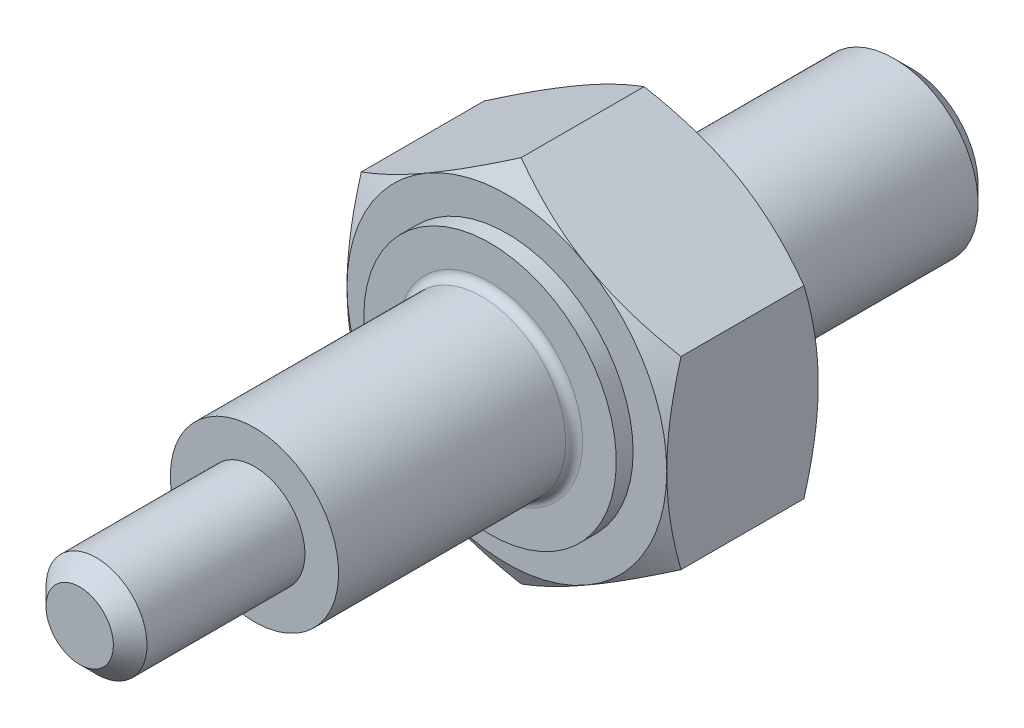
ISO-10303-21;
HEADER;
FILE_DESCRIPTION(('STEP AP214'),'2;1');
FILE_NAME('part.step','',(''),(''),'','','');
FILE_SCHEMA(('AUTOMOTIVE_DESIGN { 1 0 10303 214 1 1 1 1 }'));
ENDSEC;
DATA;
#1=APPLICATION_CONTEXT('core data for automotive mechanical design processes');
#2=APPLICATION_PROTOCOL_DEFINITION('international standard','automotive_design',2000,#1);
#3=PRODUCT_CONTEXT('',#1,'mechanical');
#4=PRODUCT('Part','Part','',(#3));
#5=PRODUCT_RELATED_PRODUCT_CATEGORY('part','',(#4));
#6=PRODUCT_DEFINITION_FORMATION('','',#4);
#7=PRODUCT_DEFINITION_CONTEXT('part definition',#1,'design');
#8=PRODUCT_DEFINITION('design','',#6,#7);
#9=PRODUCT_DEFINITION_SHAPE('','',#8);
#10=(LENGTH_UNIT() NAMED_UNIT(*) SI_UNIT(.MILLI.,.METRE.));
#11=(NAMED_UNIT(*) PLANE_ANGLE_UNIT() SI_UNIT($,.RADIAN.));
#12=(NAMED_UNIT(*) SI_UNIT($,.STERADIAN.) SOLID_ANGLE_UNIT());
#13=UNCERTAINTY_MEASURE_WITH_UNIT(LENGTH_MEASURE(1.E-05),#10,'distance_accuracy_value','');
#14=(GEOMETRIC_REPRESENTATION_CONTEXT(3) GLOBAL_UNCERTAINTY_ASSIGNED_CONTEXT((#13)) GLOBAL_UNIT_ASSIGNED_CONTEXT((#10,
#11,#12)) REPRESENTATION_CONTEXT('',''));
#15=CARTESIAN_POINT('',(0.,0.,0.));
#16=DIRECTION('',(0.,0.,1.));
#17=DIRECTION('',(1.,0.,0.));
#18=AXIS2_PLACEMENT_3D('',#15,#16,#17);
#19=CARTESIAN_POINT('',(-18.9999999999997,0.,8.99999999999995));
#20=DIRECTION('',(0.,0.,1.));
#21=DIRECTION('',(1.,0.,0.));
#22=AXIS2_PLACEMENT_3D('',#19,#20,#21);
#23=PLANE('',#22);
#24=CARTESIAN_POINT('',(0.,0.,9.));
#25=DIRECTION('',(0.,0.,1.));
#26=DIRECTION('',(1.,0.,0.));
#27=AXIS2_PLACEMENT_3D('',#24,#25,#26);
#28=CIRCLE('',#27,9.5);
#29=CARTESIAN_POINT('',(9.50000000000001,0.,9.));
#30=VERTEX_POINT('',#29);
#31=CARTESIAN_POINT('',(4.75,8.22724133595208,8.99999999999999));
#32=VERTEX_POINT('',#31);
#33=EDGE_CURVE('E11',#30,#32,#28,.T.);
#34=ORIENTED_EDGE('',*,*,#33,.T.);
#35=CARTESIAN_POINT('',(-4.75000000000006,8.22724133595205,8.99999999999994));
#36=VERTEX_POINT('',#35);
#37=EDGE_CURVE('E25',#32,#36,#28,.T.);
#38=ORIENTED_EDGE('',*,*,#37,.T.);
#39=CARTESIAN_POINT('',(-9.50000000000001,0.,8.99999999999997));
#40=VERTEX_POINT('',#39);
#41=EDGE_CURVE('E307',#36,#40,#28,.T.);
#42=ORIENTED_EDGE('',*,*,#41,.T.);
#43=CARTESIAN_POINT('',(-4.75,-8.22724133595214,8.99999999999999));
#44=VERTEX_POINT('',#43);
#45=EDGE_CURVE('E308',#40,#44,#28,.T.);
#46=ORIENTED_EDGE('',*,*,#45,.T.);
#47=CARTESIAN_POINT('',(4.75,-8.22724133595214,8.99999999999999));
#48=VERTEX_POINT('',#47);
#49=EDGE_CURVE('E310',#44,#48,#28,.T.);
#50=ORIENTED_EDGE('',*,*,#49,.T.);
#51=EDGE_CURVE('E20',#48,#30,#28,.T.);
#52=ORIENTED_EDGE('',*,*,#51,.T.);
#53=EDGE_LOOP('',(#34,#38,#42,#46,#50,#52));
#54=FACE_BOUND('',#53,.T.);
#55=CARTESIAN_POINT('',(-1.11022302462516E-13,0.,9.));
#56=DIRECTION('',(0.,0.,1.));
#57=DIRECTION('',(1.,0.,0.));
#58=AXIS2_PLACEMENT_3D('',#55,#56,#57);
#59=CIRCLE('',#58,7.5);
#60=CARTESIAN_POINT('',(7.49999999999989,0.,9.00000000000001));
#61=VERTEX_POINT('',#60);
#62=EDGE_CURVE('E131',#61,#61,#59,.F.);
#63=ORIENTED_EDGE('',*,*,#62,.T.);
#64=EDGE_LOOP('',(#63));
#65=FACE_BOUND('',#64,.T.);
#66=ADVANCED_FACE('F16',(#54,#65),#23,.T.);
#67=CARTESIAN_POINT('',(-18.9999999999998,0.,0.));
#68=DIRECTION('',(0.,0.,1.));
#69=DIRECTION('',(1.,0.,0.));
#70=AXIS2_PLACEMENT_3D('',#67,#68,#69);
#71=PLANE('',#70);
#72=CARTESIAN_POINT('',(0.,0.,0.));
#73=DIRECTION('',(0.,0.,-1.));
#74=DIRECTION('',(-1.,0.,0.));
#75=AXIS2_PLACEMENT_3D('',#72,#73,#74);
#76=CIRCLE('',#75,5.79999999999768);
#77=CARTESIAN_POINT('',(-5.79999999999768,0.,0.));
#78=VERTEX_POINT('',#77);
#79=EDGE_CURVE('E416',#78,#78,#76,.T.);
#80=ORIENTED_EDGE('',*,*,#79,.F.);
#81=EDGE_LOOP('',(#80));
#82=FACE_BOUND('',#81,.T.);
#83=CARTESIAN_POINT('',(0.,0.,0.));
#84=DIRECTION('',(0.,0.,1.));
#85=DIRECTION('',(1.,0.,0.));
#86=AXIS2_PLACEMENT_3D('',#83,#84,#85);
#87=CIRCLE('',#86,9.5);
#88=CARTESIAN_POINT('',(4.75,8.22724133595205,0.));
#89=VERTEX_POINT('',#88);
#90=CARTESIAN_POINT('',(-4.75,8.22724133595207,0.));
#91=VERTEX_POINT('',#90);
#92=EDGE_CURVE('E115',#89,#91,#87,.T.);
#93=ORIENTED_EDGE('',*,*,#92,.F.);
#94=CARTESIAN_POINT('',(9.50000000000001,0.,0.));
#95=VERTEX_POINT('',#94);
#96=EDGE_CURVE('E105',#95,#89,#87,.T.);
#97=ORIENTED_EDGE('',*,*,#96,.F.);
#98=CARTESIAN_POINT('',(4.75,-8.22724133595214,0.));
#99=VERTEX_POINT('',#98);
#100=EDGE_CURVE('E32',#99,#95,#87,.T.);
#101=ORIENTED_EDGE('',*,*,#100,.F.);
#102=CARTESIAN_POINT('',(-4.75000000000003,-8.22724133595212,0.));
#103=VERTEX_POINT('',#102);
#104=EDGE_CURVE('E40',#103,#99,#87,.T.);
#105=ORIENTED_EDGE('',*,*,#104,.F.);
#106=CARTESIAN_POINT('',(-9.50000000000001,0.,0.));
#107=VERTEX_POINT('',#106);
#108=EDGE_CURVE('E136',#107,#103,#87,.T.);
#109=ORIENTED_EDGE('',*,*,#108,.F.);
#110=EDGE_CURVE('E135',#91,#107,#87,.T.);
#111=ORIENTED_EDGE('',*,*,#110,.F.);
#112=EDGE_LOOP('',(#93,#97,#101,#105,#109,#111));
#113=FACE_BOUND('',#112,.T.);
#114=ADVANCED_FACE('F133',(#82,#113),#71,.F.);
#115=CARTESIAN_POINT('',(-9.4999999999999,5.48482755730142,8.99999999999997));
#116=DIRECTION('',(0.500000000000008,-0.866025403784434,0.));
#117=DIRECTION('',(0.866025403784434,0.500000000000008,0.));
#118=AXIS2_PLACEMENT_3D('',#115,#116,#117);
#119=PLANE('',#118);
#120=CARTESIAN_POINT('',(0.000200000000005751,10.9697705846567,8.15142755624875));
#121=CARTESIAN_POINT('',(-0.2086307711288,10.8492020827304,8.22102656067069));
#122=CARTESIAN_POINT('',(-0.418240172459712,10.7281840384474,8.2874666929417));
#123=CARTESIAN_POINT('',(-0.839139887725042,10.4851774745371,8.41315271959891));
#124=CARTESIAN_POINT('',(-1.05043073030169,10.3631886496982,8.47239624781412));
#125=CARTESIAN_POINT('',(-1.68770779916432,9.99525656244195,8.63818542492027));
#126=CARTESIAN_POINT('',(-2.11620976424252,9.74786083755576,8.73248555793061));
#127=CARTESIAN_POINT('',(-2.75744333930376,9.37764446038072,8.84306129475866));
#128=CARTESIAN_POINT('',(-2.96825921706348,9.2559298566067,8.87456017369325));
#129=CARTESIAN_POINT('',(-3.3908670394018,9.01193711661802,8.92738179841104));
#130=CARTESIAN_POINT('',(-3.60265900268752,8.88965896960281,8.94870434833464));
#131=CARTESIAN_POINT('',(-4.02659621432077,8.64489870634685,8.98062697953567));
#132=CARTESIAN_POINT('',(-4.23874074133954,8.52241700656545,8.99123980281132));
#133=CARTESIAN_POINT('',(-4.66322575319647,8.27734047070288,9.00151746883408));
#134=CARTESIAN_POINT('',(-4.87556623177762,8.15474563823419,9.00118264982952));
#135=CARTESIAN_POINT('',(-5.27254199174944,7.9255515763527,8.99032663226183));
#136=CARTESIAN_POINT('',(-5.45720529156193,7.81893617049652,8.98112973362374));
#137=CARTESIAN_POINT('',(-5.82610000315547,7.60595470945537,8.95463460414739));
#138=CARTESIAN_POINT('',(-6.01033138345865,7.49958867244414,8.93733580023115));
#139=CARTESIAN_POINT('',(-6.562311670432,7.1809027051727,8.87369551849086));
#140=CARTESIAN_POINT('',(-6.92908353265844,6.96914687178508,8.81561809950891));
#141=CARTESIAN_POINT('',(-7.66651782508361,6.54338898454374,8.67042398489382));
#142=CARTESIAN_POINT('',(-8.03708614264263,6.32944126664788,8.58269183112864));
#143=CARTESIAN_POINT('',(-8.77269671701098,5.90473630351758,8.38357626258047));
#144=CARTESIAN_POINT('',(-9.13774839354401,5.69397361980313,8.27223961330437));
#145=CARTESIAN_POINT('',(-9.50020000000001,5.48471208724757,8.15142755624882));
#146=B_SPLINE_CURVE_WITH_KNOTS('',3,(#120,#121,#122,#123,#124,#125,#126,#127,#128,#129,#130,
#131,#132,#133,#134,#135,#136,#137,#138,#139,#140,#141,#142,#143,#144,#145),.UNSPECIFIED.,.F.,
.F.,(4,2,2,2,2,2,2,2,2,2,2,2,4),(0.,0.752880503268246,1.50600787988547,3.01546870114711,
3.75167336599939,4.48789219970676,5.22323407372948,5.95855322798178,6.59868084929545,
7.23885375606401,8.52010929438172,9.82978009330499,11.1368800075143),.UNSPECIFIED.);
#147=CARTESIAN_POINT('',(0.,10.9696551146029,8.15149422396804));
#148=VERTEX_POINT('',#147);
#149=EDGE_CURVE('E153',#148,#36,#146,.T.);
#150=ORIENTED_EDGE('',*,*,#149,.F.);
#151=DIRECTION('',(0.,0.,-1.));
#152=VECTOR('',#151,1.);
#153=CARTESIAN_POINT('',(0.,10.9696551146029,8.99999999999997));
#154=LINE('',#153,#152);
#155=CARTESIAN_POINT('',(0.,10.9696551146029,0.848505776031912));
#156=VERTEX_POINT('',#155);
#157=EDGE_CURVE('E151',#148,#156,#154,.T.);
#158=ORIENTED_EDGE('',*,*,#157,.T.);
#159=CARTESIAN_POINT('',(-9.50019999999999,5.48471208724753,0.848572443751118));
#160=CARTESIAN_POINT('',(-9.29136922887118,5.60528058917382,0.778973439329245));
#161=CARTESIAN_POINT('',(-9.08175982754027,5.7262986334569,0.712533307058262));
#162=CARTESIAN_POINT('',(-8.66086011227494,5.96930519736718,0.586847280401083));
#163=CARTESIAN_POINT('',(-8.44956926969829,6.09129402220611,0.527603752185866));
#164=CARTESIAN_POINT('',(-7.81229220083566,6.45922610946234,0.361814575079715));
#165=CARTESIAN_POINT('',(-7.38379023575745,6.70662183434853,0.267514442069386));
#166=CARTESIAN_POINT('',(-6.74255666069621,7.07683821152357,0.15693870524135));
#167=CARTESIAN_POINT('',(-6.5317407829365,7.19855281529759,0.125439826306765));
#168=CARTESIAN_POINT('',(-6.10913296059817,7.44254555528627,0.0726182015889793));
#169=CARTESIAN_POINT('',(-5.89734099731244,7.56482370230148,0.051295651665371));
#170=CARTESIAN_POINT('',(-5.4734037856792,7.80958396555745,0.0193730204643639));
#171=CARTESIAN_POINT('',(-5.26125925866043,7.93206566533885,0.00876019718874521));
#172=CARTESIAN_POINT('',(-4.8367742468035,8.17714220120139,-0.00151746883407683));
#173=CARTESIAN_POINT('',(-4.62443376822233,8.29973703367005,-0.00118264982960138));
#174=CARTESIAN_POINT('',(-4.22745800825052,8.52893109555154,0.00967336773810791));
#175=CARTESIAN_POINT('',(-4.04279470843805,8.63554650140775,0.0188702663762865));
#176=CARTESIAN_POINT('',(-3.67389999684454,8.84852796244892,0.0453653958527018));
#177=CARTESIAN_POINT('',(-3.48966861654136,8.95489399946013,0.0626641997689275));
#178=CARTESIAN_POINT('',(-2.93768832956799,9.27357996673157,0.126304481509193));
#179=CARTESIAN_POINT('',(-2.57091646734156,9.48533580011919,0.184381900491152));
#180=CARTESIAN_POINT('',(-1.83348217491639,9.91109368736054,0.329576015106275));
#181=CARTESIAN_POINT('',(-1.46291385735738,10.1250414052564,0.417308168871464));
#182=CARTESIAN_POINT('',(-0.727303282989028,10.5497463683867,0.616423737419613));
#183=CARTESIAN_POINT('',(-0.362251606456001,10.7605090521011,0.72776038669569));
#184=CARTESIAN_POINT('',(0.000200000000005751,10.9697705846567,0.848572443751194));
#185=B_SPLINE_CURVE_WITH_KNOTS('',3,(#159,#160,#161,#162,#163,#164,#165,#166,#167,#168,#169,
#170,#171,#172,#173,#174,#175,#176,#177,#178,#179,#180,#181,#182,#183,#184),.UNSPECIFIED.,.F.,
.F.,(4,2,2,2,2,2,2,2,2,2,2,2,4),(0.,0.752880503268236,1.50600787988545,3.0154687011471,
3.75167336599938,4.48789219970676,5.22323407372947,5.95855322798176,6.59868084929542,
7.23885375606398,8.52010929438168,9.82978009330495,11.1368800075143),.UNSPECIFIED.);
#186=EDGE_CURVE('E122',#91,#156,#185,.T.);
#187=ORIENTED_EDGE('',*,*,#186,.F.);
#188=CARTESIAN_POINT('',(-9.4999999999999,5.48482755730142,0.848505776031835));
#189=VERTEX_POINT('',#188);
#190=EDGE_CURVE('E237',#189,#91,#185,.T.);
#191=ORIENTED_EDGE('',*,*,#190,.F.);
#192=DIRECTION('',(0.,0.,-1.));
#193=VECTOR('',#192,1.);
#194=CARTESIAN_POINT('',(-9.4999999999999,5.48482755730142,8.99999999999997));
#195=LINE('',#194,#193);
#196=CARTESIAN_POINT('',(-9.4999999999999,5.48482755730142,8.15149422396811));
#197=VERTEX_POINT('',#196);
#198=EDGE_CURVE('E138',#197,#189,#195,.T.);
#199=ORIENTED_EDGE('',*,*,#198,.F.);
#200=EDGE_CURVE('E154',#36,#197,#146,.T.);
#201=ORIENTED_EDGE('',*,*,#200,.F.);
#202=EDGE_LOOP('',(#150,#158,#187,#191,#199,#201));
#203=FACE_BOUND('',#202,.T.);
#204=ADVANCED_FACE('F252',(#203),#119,.F.);
#205=CARTESIAN_POINT('',(-9.4999999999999,5.48482755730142,8.99999999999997));
#206=DIRECTION('',(1.,0.,0.));
#207=DIRECTION('',(0.,1.,0.));
#208=AXIS2_PLACEMENT_3D('',#205,#206,#207);
#209=PLANE('',#208);
#210=CARTESIAN_POINT('',(-9.49999999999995,-14.7418622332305,4.35940572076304));
#211=CARTESIAN_POINT('',(-9.49999999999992,-14.5343385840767,4.46011673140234));
#212=CARTESIAN_POINT('',(-9.4999999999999,-14.3265716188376,4.56032613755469));
#213=CARTESIAN_POINT('',(-9.49999999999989,-13.9105002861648,4.75962813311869));
#214=CARTESIAN_POINT('',(-9.4999999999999,-13.7021959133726,4.85872071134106));
#215=CARTESIAN_POINT('',(-9.4999999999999,-13.0763451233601,5.15417887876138));
#216=CARTESIAN_POINT('',(-9.4999999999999,-12.6579223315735,5.34869507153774));
#217=CARTESIAN_POINT('',(-9.4999999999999,-11.8160068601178,5.73266584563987));
#218=CARTESIAN_POINT('',(-9.4999999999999,-11.3924989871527,5.92208719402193));
#219=CARTESIAN_POINT('',(-9.4999999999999,-10.5421179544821,6.29319117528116));
#220=CARTESIAN_POINT('',(-9.4999999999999,-10.1152449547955,6.4748741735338));
#221=CARTESIAN_POINT('',(-9.4999999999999,-9.24376431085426,6.83409615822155));
#222=CARTESIAN_POINT('',(-9.4999999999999,-8.79902527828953,7.0113181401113));
#223=CARTESIAN_POINT('',(-9.4999999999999,-7.90434890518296,7.35237119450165));
#224=CARTESIAN_POINT('',(-9.4999999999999,-7.45441098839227,7.51620076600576));
#225=CARTESIAN_POINT('',(-9.4999999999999,-6.54945414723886,7.82617486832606));
#226=CARTESIAN_POINT('',(-9.4999999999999,-6.09444758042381,7.97235508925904));
#227=CARTESIAN_POINT('',(-9.4999999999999,-5.17792470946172,8.24234834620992));
#228=CARTESIAN_POINT('',(-9.4999999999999,-4.71641050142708,8.36616841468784));
#229=CARTESIAN_POINT('',(-9.4999999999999,-3.78903200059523,8.58485474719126));
#230=CARTESIAN_POINT('',(-9.4999999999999,-3.32320489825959,8.67987446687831));
#231=CARTESIAN_POINT('',(-9.4999999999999,-2.62021577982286,8.79668000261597));
#232=CARTESIAN_POINT('',(-9.4999999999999,-2.38516116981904,8.83132938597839));
#233=CARTESIAN_POINT('',(-9.4999999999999,-1.91388055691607,8.8913741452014));
#234=CARTESIAN_POINT('',(-9.4999999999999,-1.67765466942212,8.91677041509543));
#235=CARTESIAN_POINT('',(-9.4999999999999,-1.20744003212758,8.95748381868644));
#236=CARTESIAN_POINT('',(-9.4999999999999,-0.973462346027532,8.97292822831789));
#237=CARTESIAN_POINT('',(-9.4999999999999,-0.505063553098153,8.99390847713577));
#238=CARTESIAN_POINT('',(-9.4999999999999,-0.270642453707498,8.99944448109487));
#239=CARTESIAN_POINT('',(-9.4999999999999,0.198225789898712,9.00047584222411));
#240=CARTESIAN_POINT('',(-9.4999999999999,0.432672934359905,8.99597109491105));
#241=CARTESIAN_POINT('',(-9.4999999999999,0.901168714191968,8.97703099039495));
#242=CARTESIAN_POINT('',(-9.4999999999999,1.13521732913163,8.96259513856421));
#243=CARTESIAN_POINT('',(-9.4999999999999,1.69732893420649,8.91630436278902));
#244=CARTESIAN_POINT('',(-9.4999999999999,2.0250137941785,8.87975872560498));
#245=CARTESIAN_POINT('',(-9.4999999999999,2.67794286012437,8.78919137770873));
#246=CARTESIAN_POINT('',(-9.4999999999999,3.00318673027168,8.73516730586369));
#247=CARTESIAN_POINT('',(-9.4999999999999,3.97488110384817,8.54974297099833));
#248=CARTESIAN_POINT('',(-9.4999999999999,4.61694008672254,8.39502361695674));
#249=CARTESIAN_POINT('',(-9.4999999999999,5.57721514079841,8.12677808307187));
#250=CARTESIAN_POINT('',(-9.4999999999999,5.90040983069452,8.03005103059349));
#251=CARTESIAN_POINT('',(-9.4999999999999,6.5436588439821,7.82657182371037));
#252=CARTESIAN_POINT('',(-9.4999999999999,6.86371314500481,7.71981959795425));
#253=CARTESIAN_POINT('',(-9.4999999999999,7.50078526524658,7.49800152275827));
#254=CARTESIAN_POINT('',(-9.4999999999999,7.81780402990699,7.38293836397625));
#255=CARTESIAN_POINT('',(-9.4999999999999,8.44921336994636,7.14585048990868));
#256=CARTESIAN_POINT('',(-9.4999999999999,8.76360399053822,7.02382589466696));
#257=CARTESIAN_POINT('',(-9.4999999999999,9.56231098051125,6.7052752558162));
#258=CARTESIAN_POINT('',(-9.4999999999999,10.0450020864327,6.50467949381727));
#259=CARTESIAN_POINT('',(-9.49999999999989,11.0058456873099,6.09286323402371));
#260=CARTESIAN_POINT('',(-9.49999999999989,11.483997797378,5.88164184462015));
#261=CARTESIAN_POINT('',(-9.49999999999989,12.4367208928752,5.45092372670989));
#262=CARTESIAN_POINT('',(-9.49999999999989,12.9112907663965,5.2314245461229));
#263=CARTESIAN_POINT('',(-9.49999999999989,13.8573768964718,4.78599614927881));
#264=CARTESIAN_POINT('',(-9.49999999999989,14.3288932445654,4.56006712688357));
#265=CARTESIAN_POINT('',(-9.49999999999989,15.2700647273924,4.10278852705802));
#266=CARTESIAN_POINT('',(-9.49999999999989,15.7397165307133,3.8714321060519));
#267=CARTESIAN_POINT('',(-9.49999999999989,16.6769636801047,3.40458987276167));
#268=CARTESIAN_POINT('',(-9.49999999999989,17.1445590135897,3.16910403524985));
#269=CARTESIAN_POINT('',(-9.49999999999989,18.0779587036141,2.69481041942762));
#270=CARTESIAN_POINT('',(-9.49999999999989,18.5437633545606,2.45600321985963));
#271=CARTESIAN_POINT('',(-9.49999999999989,19.4739407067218,1.97561460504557));
#272=CARTESIAN_POINT('',(-9.49999999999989,19.9383134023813,1.73403317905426));
#273=CARTESIAN_POINT('',(-9.49999999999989,21.2409956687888,1.05223028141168));
#274=CARTESIAN_POINT('',(-9.49999999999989,22.0779387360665,0.609398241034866));
#275=CARTESIAN_POINT('',(-9.49999999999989,23.7489212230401,-0.281793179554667));
#276=CARTESIAN_POINT('',(-9.49999999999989,24.5829605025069,-0.73015282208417));
#277=CARTESIAN_POINT('',(-9.49999999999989,26.2463792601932,-1.62974030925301));
#278=CARTESIAN_POINT('',(-9.49999999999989,27.0757652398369,-2.08095614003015));
#279=CARTESIAN_POINT('',(-9.49999999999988,28.3185014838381,-2.76016985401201));
#280=CARTESIAN_POINT('',(-9.49999999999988,28.7325097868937,-2.98696540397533));
#281=CARTESIAN_POINT('',(-9.49999999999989,29.5601333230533,-3.44127132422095));
#282=CARTESIAN_POINT('',(-9.49999999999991,29.97374855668,-3.66878169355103));
#283=CARTESIAN_POINT('',(-9.49999999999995,30.3871905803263,-3.89660647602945));
#284=B_SPLINE_CURVE_WITH_KNOTS('',3,(#210,#211,#212,#213,#214,#215,#216,#217,#218,#219,#220,
#221,#222,#223,#224,#225,#226,#227,#228,#229,#230,#231,#232,#233,#234,#235,#236,#237,#238,#239,
#240,#241,#242,#243,#244,#245,#246,#247,#248,#249,#250,#251,#252,#253,#254,#255,#256,#257,#258,
#259,#260,#261,#262,#263,#264,#265,#266,#267,#268,#269,#270,#271,#272,#273,#274,#275,#276,#277,
#278,#279,#280,#281,#282,#283),.UNSPECIFIED.,.F.,.F.,(4,2,2,2,2,2,2,2,2,2,2,2,2,2,2,2,2,2,2,2,2,
2,2,2,2,2,2,2,2,2,2,2,2,2,2,2,4),(0.,0.692009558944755,1.38402604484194,2.76826351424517,
4.16001992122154,5.55171054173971,6.98778973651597,8.42402966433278,9.85731480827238,
11.2901483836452,12.7152075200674,13.4278382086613,14.140400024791,14.8436577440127,
15.5469037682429,16.2501571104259,16.9534454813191,17.9420368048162,18.9307617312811,
20.9092742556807,21.9212660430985,22.9332650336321,23.944937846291,24.9565932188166,
26.5245512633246,28.0926410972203,29.6611991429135,31.2297099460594,32.8003178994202,
34.3709354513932,35.941282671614,37.511635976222,40.3522316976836,43.1929627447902,
46.0254944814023,47.4416690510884,48.8578417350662),.UNSPECIFIED.);
#285=EDGE_CURVE('E161',#197,#40,#284,.F.);
#286=ORIENTED_EDGE('',*,*,#285,.F.);
#287=ORIENTED_EDGE('',*,*,#198,.T.);
#288=CARTESIAN_POINT('',(-9.49999999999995,-14.7418622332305,4.64059427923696));
#289=CARTESIAN_POINT('',(-9.49999999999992,-14.5343385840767,4.53988326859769));
#290=CARTESIAN_POINT('',(-9.4999999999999,-14.3265716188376,4.43967386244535));
#291=CARTESIAN_POINT('',(-9.49999999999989,-13.9105002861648,4.24037186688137));
#292=CARTESIAN_POINT('',(-9.4999999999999,-13.7021959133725,4.14127928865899));
#293=CARTESIAN_POINT('',(-9.4999999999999,-13.0763451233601,3.84582112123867));
#294=CARTESIAN_POINT('',(-9.4999999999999,-12.6579223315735,3.65130492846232));
#295=CARTESIAN_POINT('',(-9.4999999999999,-11.8160068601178,3.26733415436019));
#296=CARTESIAN_POINT('',(-9.4999999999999,-11.3924989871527,3.07791280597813));
#297=CARTESIAN_POINT('',(-9.4999999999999,-10.5421179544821,2.7068088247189));
#298=CARTESIAN_POINT('',(-9.4999999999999,-10.1152449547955,2.52512582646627));
#299=CARTESIAN_POINT('',(-9.4999999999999,-9.24376431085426,2.16590384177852));
#300=CARTESIAN_POINT('',(-9.4999999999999,-8.79902527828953,1.98868185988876));
#301=CARTESIAN_POINT('',(-9.4999999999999,-7.90434890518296,1.64762880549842));
#302=CARTESIAN_POINT('',(-9.4999999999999,-7.45441098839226,1.4837992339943));
#303=CARTESIAN_POINT('',(-9.4999999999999,-6.54945414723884,1.17382513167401));
#304=CARTESIAN_POINT('',(-9.4999999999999,-6.09444758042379,1.02764491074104));
#305=CARTESIAN_POINT('',(-9.4999999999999,-5.17792470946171,0.757651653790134));
#306=CARTESIAN_POINT('',(-9.4999999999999,-4.71641050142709,0.633831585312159));
#307=CARTESIAN_POINT('',(-9.4999999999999,-3.78903200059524,0.415145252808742));
#308=CARTESIAN_POINT('',(-9.49999999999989,-3.32320489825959,0.320125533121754));
#309=CARTESIAN_POINT('',(-9.49999999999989,-2.62021577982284,0.203319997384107));
#310=CARTESIAN_POINT('',(-9.49999999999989,-2.38516116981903,0.168670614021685));
#311=CARTESIAN_POINT('',(-9.49999999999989,-1.91388055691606,0.108625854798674));
#312=CARTESIAN_POINT('',(-9.49999999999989,-1.6776546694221,0.083229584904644));
#313=CARTESIAN_POINT('',(-9.49999999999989,-1.20744003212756,0.042516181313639));
#314=CARTESIAN_POINT('',(-9.4999999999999,-0.973462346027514,0.0270717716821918));
#315=CARTESIAN_POINT('',(-9.49999999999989,-0.505063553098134,0.00609152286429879));
#316=CARTESIAN_POINT('',(-9.49999999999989,-0.270642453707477,0.000555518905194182));
#317=CARTESIAN_POINT('',(-9.4999999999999,0.198225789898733,-0.000475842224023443));
#318=CARTESIAN_POINT('',(-9.49999999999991,0.432672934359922,0.00402890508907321));
#319=CARTESIAN_POINT('',(-9.49999999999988,0.901168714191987,0.0229690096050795));
#320=CARTESIAN_POINT('',(-9.49999999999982,1.13521732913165,0.0374048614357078));
#321=CARTESIAN_POINT('',(-9.4999999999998,1.6973289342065,0.0836956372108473));
#322=CARTESIAN_POINT('',(-9.49999999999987,2.02501379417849,0.120241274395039));
#323=CARTESIAN_POINT('',(-9.49999999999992,2.67794286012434,0.210808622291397));
#324=CARTESIAN_POINT('',(-9.4999999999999,3.00318673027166,0.264832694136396));
#325=CARTESIAN_POINT('',(-9.49999999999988,3.97488110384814,0.450257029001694));
#326=CARTESIAN_POINT('',(-9.49999999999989,4.61694008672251,0.604976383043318));
#327=CARTESIAN_POINT('',(-9.4999999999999,5.57721514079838,0.873221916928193));
#328=CARTESIAN_POINT('',(-9.4999999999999,5.9004098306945,0.96994896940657));
#329=CARTESIAN_POINT('',(-9.49999999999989,6.54365884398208,1.17342817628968));
#330=CARTESIAN_POINT('',(-9.49999999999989,6.8637131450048,1.2801804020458));
#331=CARTESIAN_POINT('',(-9.4999999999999,7.50078526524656,1.5019984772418));
#332=CARTESIAN_POINT('',(-9.49999999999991,7.81780402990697,1.61706163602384));
#333=CARTESIAN_POINT('',(-9.49999999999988,8.44921336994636,1.85414951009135));
#334=CARTESIAN_POINT('',(-9.49999999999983,8.76360399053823,1.976174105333));
#335=CARTESIAN_POINT('',(-9.4999999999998,9.56231098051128,2.29472474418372));
#336=CARTESIAN_POINT('',(-9.49999999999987,10.0450020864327,2.49532050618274));
#337=CARTESIAN_POINT('',(-9.49999999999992,11.0058456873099,2.90713676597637));
#338=CARTESIAN_POINT('',(-9.4999999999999,11.4839977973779,3.11835815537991));
#339=CARTESIAN_POINT('',(-9.49999999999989,12.4367208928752,3.54907627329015));
#340=CARTESIAN_POINT('',(-9.49999999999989,12.9112907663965,3.76857545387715));
#341=CARTESIAN_POINT('',(-9.4999999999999,13.8573768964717,4.21400385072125));
#342=CARTESIAN_POINT('',(-9.49999999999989,14.3288932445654,4.43993287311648));
#343=CARTESIAN_POINT('',(-9.49999999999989,15.2700647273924,4.89721147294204));
#344=CARTESIAN_POINT('',(-9.49999999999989,15.7397165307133,5.12856789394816));
#345=CARTESIAN_POINT('',(-9.49999999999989,16.6769636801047,5.59541012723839));
#346=CARTESIAN_POINT('',(-9.49999999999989,17.1445590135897,5.83089596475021));
#347=CARTESIAN_POINT('',(-9.49999999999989,18.0779587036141,6.30518958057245));
#348=CARTESIAN_POINT('',(-9.49999999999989,18.5437633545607,6.54399678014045));
#349=CARTESIAN_POINT('',(-9.49999999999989,19.4739407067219,7.02438539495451));
#350=CARTESIAN_POINT('',(-9.49999999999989,19.9383134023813,7.26596682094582));
#351=CARTESIAN_POINT('',(-9.49999999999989,21.2409956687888,7.9477697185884));
#352=CARTESIAN_POINT('',(-9.49999999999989,22.0779387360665,8.39060175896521));
#353=CARTESIAN_POINT('',(-9.49999999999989,23.7489212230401,9.28179317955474));
#354=CARTESIAN_POINT('',(-9.49999999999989,24.582960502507,9.73015282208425));
#355=CARTESIAN_POINT('',(-9.49999999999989,26.2463792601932,10.6297403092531));
#356=CARTESIAN_POINT('',(-9.4999999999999,27.0757652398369,11.0809561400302));
#357=CARTESIAN_POINT('',(-9.4999999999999,28.3185014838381,11.7601698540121));
#358=CARTESIAN_POINT('',(-9.4999999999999,28.7325097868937,11.9869654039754));
#359=CARTESIAN_POINT('',(-9.4999999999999,29.5601333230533,12.441271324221));
#360=CARTESIAN_POINT('',(-9.4999999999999,29.97374855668,12.668781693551));
#361=CARTESIAN_POINT('',(-9.4999999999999,30.3871905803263,12.8966064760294));
#362=B_SPLINE_CURVE_WITH_KNOTS('',3,(#288,#289,#290,#291,#292,#293,#294,#295,#296,#297,#298,
#299,#300,#301,#302,#303,#304,#305,#306,#307,#308,#309,#310,#311,#312,#313,#314,#315,#316,#317,
#318,#319,#320,#321,#322,#323,#324,#325,#326,#327,#328,#329,#330,#331,#332,#333,#334,#335,#336,
#337,#338,#339,#340,#341,#342,#343,#344,#345,#346,#347,#348,#349,#350,#351,#352,#353,#354,#355,
#356,#357,#358,#359,#360,#361),.UNSPECIFIED.,.F.,.F.,(4,2,2,2,2,2,2,2,2,2,2,2,2,2,2,2,2,2,2,2,2,
2,2,2,2,2,2,2,2,2,2,2,2,2,2,2,4),(0.,0.692009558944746,1.38402604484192,2.76826351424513,
4.16001992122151,5.55171054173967,6.98778973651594,8.42402966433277,9.85731480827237,
11.2901483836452,12.7152075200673,13.4278382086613,14.140400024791,14.8436577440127,
15.5469037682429,16.2501571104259,16.9534454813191,17.9420368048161,18.9307617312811,
20.9092742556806,21.9212660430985,22.933265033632,23.944937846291,24.9565932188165,
26.5245512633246,28.0926410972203,29.6611991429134,31.2297099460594,32.8003178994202,
34.3709354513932,35.941282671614,37.511635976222,40.3522316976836,43.1929627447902,
46.0254944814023,47.4416690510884,48.8578417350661),.UNSPECIFIED.);
#363=EDGE_CURVE('E221',#107,#189,#362,.T.);
#364=ORIENTED_EDGE('',*,*,#363,.F.);
#365=CARTESIAN_POINT('',(-9.4999999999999,-5.48482755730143,0.848505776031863));
#366=VERTEX_POINT('',#365);
#367=EDGE_CURVE('E226',#366,#107,#362,.T.);
#368=ORIENTED_EDGE('',*,*,#367,.F.);
#369=DIRECTION('',(0.,0.,-1.));
#370=VECTOR('',#369,1.);
#371=CARTESIAN_POINT('',(-9.4999999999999,-5.48482755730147,9.));
#372=LINE('',#371,#370);
#373=CARTESIAN_POINT('',(-9.4999999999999,-5.48482755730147,8.15149422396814));
#374=VERTEX_POINT('',#373);
#375=EDGE_CURVE('E141',#374,#366,#372,.T.);
#376=ORIENTED_EDGE('',*,*,#375,.F.);
#377=EDGE_CURVE('E162',#40,#374,#284,.F.);
#378=ORIENTED_EDGE('',*,*,#377,.F.);
#379=EDGE_LOOP('',(#286,#287,#364,#368,#376,#378));
#380=FACE_BOUND('',#379,.T.);
#381=ADVANCED_FACE('F259',(#380),#209,.F.);
#382=CARTESIAN_POINT('',(-9.4999999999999,-5.48482755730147,9.));
#383=DIRECTION('',(0.500000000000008,0.866025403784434,0.));
#384=DIRECTION('',(-0.866025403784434,0.500000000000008,0.));
#385=AXIS2_PLACEMENT_3D('',#382,#383,#384);
#386=PLANE('',#385);
#387=CARTESIAN_POINT('',(-9.50019999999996,-5.48471208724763,8.15142755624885));
#388=CARTESIAN_POINT('',(-9.29136922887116,-5.6052805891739,8.22102656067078));
#389=CARTESIAN_POINT('',(-9.08175982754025,-5.72629863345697,8.28746669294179));
#390=CARTESIAN_POINT('',(-8.66086011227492,-5.96930519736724,8.41315271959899));
#391=CARTESIAN_POINT('',(-8.44956926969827,-6.09129402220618,8.4723962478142));
#392=CARTESIAN_POINT('',(-7.81229220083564,-6.45922610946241,8.63818542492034));
#393=CARTESIAN_POINT('',(-7.38379023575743,-6.70662183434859,8.73248555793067));
#394=CARTESIAN_POINT('',(-6.74255666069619,-7.07683821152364,8.8430612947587));
#395=CARTESIAN_POINT('',(-6.53174078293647,-7.19855281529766,8.87456017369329));
#396=CARTESIAN_POINT('',(-6.10913296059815,-7.44254555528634,8.92738179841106));
#397=CARTESIAN_POINT('',(-5.89734099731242,-7.56482370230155,8.94870434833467));
#398=CARTESIAN_POINT('',(-5.47340378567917,-7.80958396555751,8.98062697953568));
#399=CARTESIAN_POINT('',(-5.26125925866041,-7.9320656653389,8.99123980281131));
#400=CARTESIAN_POINT('',(-4.83677424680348,-8.17714220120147,9.00151746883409));
#401=CARTESIAN_POINT('',(-4.62443376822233,-8.29973703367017,9.00118264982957));
#402=CARTESIAN_POINT('',(-4.22745800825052,-8.52893109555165,8.99032663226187));
#403=CARTESIAN_POINT('',(-4.04279470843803,-8.63554650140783,8.98112973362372));
#404=CARTESIAN_POINT('',(-3.6738999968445,-8.84852796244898,8.95463460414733));
#405=CARTESIAN_POINT('',(-3.48966861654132,-8.9548939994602,8.9373358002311));
#406=CARTESIAN_POINT('',(-2.93768832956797,-9.27357996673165,8.87369551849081));
#407=CARTESIAN_POINT('',(-2.57091646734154,-9.48533580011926,8.81561809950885));
#408=CARTESIAN_POINT('',(-1.83348217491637,-9.9110936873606,8.67042398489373));
#409=CARTESIAN_POINT('',(-1.46291385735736,-10.1250414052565,8.58269183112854));
#410=CARTESIAN_POINT('',(-0.727303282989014,-10.5497463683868,8.38357626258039));
#411=CARTESIAN_POINT('',(-0.362251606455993,-10.7605090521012,8.2722396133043));
#412=CARTESIAN_POINT('',(0.000200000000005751,-10.9697705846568,8.15142755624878));
#413=B_SPLINE_CURVE_WITH_KNOTS('',3,(#387,#388,#389,#390,#391,#392,#393,#394,#395,#396,#397,
#398,#399,#400,#401,#402,#403,#404,#405,#406,#407,#408,#409,#410,#411,#412),.UNSPECIFIED.,.F.,
.F.,(4,2,2,2,2,2,2,2,2,2,2,2,4),(0.,0.752880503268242,1.50600787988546,3.01546870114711,
3.75167336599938,4.48789219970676,5.22323407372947,5.95855322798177,6.59868084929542,
7.23885375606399,8.52010929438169,9.82978009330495,11.1368800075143),.UNSPECIFIED.);
#414=EDGE_CURVE('E208',#374,#44,#413,.T.);
#415=ORIENTED_EDGE('',*,*,#414,.F.);
#416=ORIENTED_EDGE('',*,*,#375,.T.);
#417=CARTESIAN_POINT('',(0.000200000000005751,-10.9697705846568,0.848572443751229));
#418=CARTESIAN_POINT('',(-0.208630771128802,-10.8492020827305,0.77897343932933));
#419=CARTESIAN_POINT('',(-0.418240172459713,-10.7281840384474,0.712533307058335));
#420=CARTESIAN_POINT('',(-0.83913988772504,-10.4851774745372,0.586847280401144));
#421=CARTESIAN_POINT('',(-1.05043073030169,-10.3631886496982,0.527603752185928));
#422=CARTESIAN_POINT('',(-1.68770779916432,-9.995256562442,0.361814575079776));
#423=CARTESIAN_POINT('',(-2.11620976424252,-9.74786083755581,0.267514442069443));
#424=CARTESIAN_POINT('',(-2.75744333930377,-9.37764446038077,0.156938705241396));
#425=CARTESIAN_POINT('',(-2.96825921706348,-9.25592985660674,0.125439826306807));
#426=CARTESIAN_POINT('',(-3.39086703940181,-9.01193711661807,0.0726182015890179));
#427=CARTESIAN_POINT('',(-3.60265900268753,-8.88965896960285,0.0512956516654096));
#428=CARTESIAN_POINT('',(-4.02659621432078,-8.64489870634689,0.0193730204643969));
#429=CARTESIAN_POINT('',(-4.23874074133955,-8.5224170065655,0.00876019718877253));
#430=CARTESIAN_POINT('',(-4.66322575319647,-8.27734047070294,-0.00151746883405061));
#431=CARTESIAN_POINT('',(-4.87556623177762,-8.15474563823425,-0.00118264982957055));
#432=CARTESIAN_POINT('',(-5.27254199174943,-7.92555157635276,0.00967336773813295));
#433=CARTESIAN_POINT('',(-5.45720529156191,-7.81893617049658,0.0188702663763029));
#434=CARTESIAN_POINT('',(-5.82610000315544,-7.60595470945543,0.0453653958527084));
#435=CARTESIAN_POINT('',(-6.01033138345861,-7.49958867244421,0.0626641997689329));
#436=CARTESIAN_POINT('',(-6.56231167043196,-7.18090270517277,0.126304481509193));
#437=CARTESIAN_POINT('',(-6.9290835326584,-6.96914687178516,0.184381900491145));
#438=CARTESIAN_POINT('',(-7.66651782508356,-6.54338898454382,0.329576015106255));
#439=CARTESIAN_POINT('',(-8.03708614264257,-6.32944126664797,0.417308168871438));
#440=CARTESIAN_POINT('',(-8.77269671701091,-5.90473630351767,0.616423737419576));
#441=CARTESIAN_POINT('',(-9.13774839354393,-5.6939736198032,0.727760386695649));
#442=CARTESIAN_POINT('',(-9.50019999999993,-5.48471208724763,0.848572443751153));
#443=B_SPLINE_CURVE_WITH_KNOTS('',3,(#417,#418,#419,#420,#421,#422,#423,#424,#425,#426,#427,
#428,#429,#430,#431,#432,#433,#434,#435,#436,#437,#438,#439,#440,#441,#442),.UNSPECIFIED.,.F.,
.F.,(4,2,2,2,2,2,2,2,2,2,2,2,4),(0.,0.752880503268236,1.50600787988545,3.01546870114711,
3.75167336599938,4.48789219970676,5.22323407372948,5.95855322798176,6.59868084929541,
7.23885375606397,8.52010929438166,9.82978009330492,11.1368800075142),.UNSPECIFIED.);
#444=EDGE_CURVE('E214',#103,#366,#443,.T.);
#445=ORIENTED_EDGE('',*,*,#444,.F.);
#446=CARTESIAN_POINT('',(0.,-10.969655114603,0.848505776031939));
#447=VERTEX_POINT('',#446);
#448=EDGE_CURVE('E219',#447,#103,#443,.T.);
#449=ORIENTED_EDGE('',*,*,#448,.F.);
#450=DIRECTION('',(0.,0.,-1.));
#451=VECTOR('',#450,1.);
#452=CARTESIAN_POINT('',(0.,-10.969655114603,9.));
#453=LINE('',#452,#451);
#454=CARTESIAN_POINT('',(0.,-10.969655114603,8.15149422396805));
#455=VERTEX_POINT('',#454);
#456=EDGE_CURVE('E144',#455,#447,#453,.T.);
#457=ORIENTED_EDGE('',*,*,#456,.F.);
#458=EDGE_CURVE('E203',#44,#455,#413,.T.);
#459=ORIENTED_EDGE('',*,*,#458,.F.);
#460=EDGE_LOOP('',(#415,#416,#445,#449,#457,#459));
#461=FACE_BOUND('',#460,.T.);
#462=ADVANCED_FACE('F263',(#461),#386,.F.);
#463=CARTESIAN_POINT('',(9.50000000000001,-5.48482755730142,8.99999999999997));
#464=DIRECTION('',(-0.5,0.866025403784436,0.));
#465=DIRECTION('',(-0.866025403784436,-0.5,0.));
#466=AXIS2_PLACEMENT_3D('',#463,#464,#465);
#467=PLANE('',#466);
#468=CARTESIAN_POINT('',(-0.000200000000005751,-10.9697705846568,8.15142755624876));
#469=CARTESIAN_POINT('',(0.208630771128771,-10.8492020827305,8.2210265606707));
#470=CARTESIAN_POINT('',(0.41824017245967,-10.7281840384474,8.28746669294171));
#471=CARTESIAN_POINT('',(0.839139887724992,-10.4851774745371,8.41315271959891));
#472=CARTESIAN_POINT('',(1.05043073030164,-10.3631886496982,8.47239624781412));
#473=CARTESIAN_POINT('',(1.68770779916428,-9.99525656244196,8.63818542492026));
#474=CARTESIAN_POINT('',(2.11620976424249,-9.74786083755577,8.7324855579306));
#475=CARTESIAN_POINT('',(2.75744333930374,-9.37764446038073,8.84306129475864));
#476=CARTESIAN_POINT('',(2.96825921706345,-9.25592985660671,8.87456017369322));
#477=CARTESIAN_POINT('',(3.39086703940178,-9.01193711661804,8.92738179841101));
#478=CARTESIAN_POINT('',(3.6026590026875,-8.88965896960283,8.94870434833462));
#479=CARTESIAN_POINT('',(4.02659621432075,-8.64489870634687,8.98062697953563));
#480=CARTESIAN_POINT('',(4.23874074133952,-8.52241700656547,8.99123980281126));
#481=CARTESIAN_POINT('',(4.66322575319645,-8.27734047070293,9.00151746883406));
#482=CARTESIAN_POINT('',(4.87556623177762,-8.15474563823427,9.00118264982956));
#483=CARTESIAN_POINT('',(5.27254199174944,-7.92555157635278,8.99032663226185));
#484=CARTESIAN_POINT('',(5.45720529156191,-7.81893617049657,8.9811297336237));
#485=CARTESIAN_POINT('',(5.82610000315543,-7.6059547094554,8.9546346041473));
#486=CARTESIAN_POINT('',(6.01033138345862,-7.49958867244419,8.93733580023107));
#487=CARTESIAN_POINT('',(6.56231167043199,-7.18090270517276,8.87369551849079));
#488=CARTESIAN_POINT('',(6.92908353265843,-6.96914687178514,8.81561809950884));
#489=CARTESIAN_POINT('',(7.66651782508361,-6.54338898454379,8.67042398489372));
#490=CARTESIAN_POINT('',(8.03708614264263,-6.32944126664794,8.58269183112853));
#491=CARTESIAN_POINT('',(8.77269671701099,-5.90473630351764,8.38357626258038));
#492=CARTESIAN_POINT('',(9.13774839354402,-5.69397361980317,8.27223961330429));
#493=CARTESIAN_POINT('',(9.50020000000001,-5.48471208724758,8.15142755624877));
#494=B_SPLINE_CURVE_WITH_KNOTS('',3,(#468,#469,#470,#471,#472,#473,#474,#475,#476,#477,#478,
#479,#480,#481,#482,#483,#484,#485,#486,#487,#488,#489,#490,#491,#492,#493),.UNSPECIFIED.,.F.,
.F.,(4,2,2,2,2,2,2,2,2,2,2,2,4),(0.,0.75288050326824,1.50600787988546,3.01546870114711,
3.75167336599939,4.48789219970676,5.22323407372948,5.95855322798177,6.59868084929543,
7.238853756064,8.52010929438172,9.82978009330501,11.1368800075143),.UNSPECIFIED.);
#495=EDGE_CURVE('E209',#455,#48,#494,.T.);
#496=ORIENTED_EDGE('',*,*,#495,.F.);
#497=ORIENTED_EDGE('',*,*,#456,.T.);
#498=CARTESIAN_POINT('',(9.50020000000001,-5.48471208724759,0.848572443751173));
#499=CARTESIAN_POINT('',(9.29136922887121,-5.60528058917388,0.778973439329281));
#500=CARTESIAN_POINT('',(9.0817598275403,-5.72629863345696,0.71253330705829));
#501=CARTESIAN_POINT('',(8.66086011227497,-5.96930519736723,0.586847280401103));
#502=CARTESIAN_POINT('',(8.44956926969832,-6.09129402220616,0.527603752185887));
#503=CARTESIAN_POINT('',(7.81229220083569,-6.45922610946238,0.361814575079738));
#504=CARTESIAN_POINT('',(7.38379023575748,-6.70662183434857,0.267514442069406));
#505=CARTESIAN_POINT('',(6.74255666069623,-7.07683821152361,0.156938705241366));
#506=CARTESIAN_POINT('',(6.53174078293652,-7.19855281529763,0.12543982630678));
#507=CARTESIAN_POINT('',(6.10913296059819,-7.44254555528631,0.0726182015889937));
#508=CARTESIAN_POINT('',(5.89734099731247,-7.56482370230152,0.0512956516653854));
#509=CARTESIAN_POINT('',(5.47340378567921,-7.80958396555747,0.0193730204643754));
#510=CARTESIAN_POINT('',(5.26125925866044,-7.93206566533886,0.00876019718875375));
#511=CARTESIAN_POINT('',(4.83677424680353,-8.17714220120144,-0.00151746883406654));
#512=CARTESIAN_POINT('',(4.62443376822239,-8.29973703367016,-0.00118264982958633));
#513=CARTESIAN_POINT('',(4.22745800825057,-8.52893109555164,0.00967336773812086));
#514=CARTESIAN_POINT('',(4.04279470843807,-8.63554650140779,0.0188702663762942));
#515=CARTESIAN_POINT('',(3.67389999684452,-8.84852796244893,0.0453653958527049));
#516=CARTESIAN_POINT('',(3.48966861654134,-8.95489399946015,0.0626641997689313));
#517=CARTESIAN_POINT('',(2.93768832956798,-9.27357996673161,0.126304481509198));
#518=CARTESIAN_POINT('',(2.57091646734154,-9.48533580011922,0.184381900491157));
#519=CARTESIAN_POINT('',(1.83348217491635,-9.91109368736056,0.329576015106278));
#520=CARTESIAN_POINT('',(1.46291385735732,-10.1250414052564,0.417308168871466));
#521=CARTESIAN_POINT('',(0.727303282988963,-10.5497463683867,0.616423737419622));
#522=CARTESIAN_POINT('',(0.362251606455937,-10.7605090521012,0.727760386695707));
#523=CARTESIAN_POINT('',(-0.000200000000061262,-10.9697705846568,0.848572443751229));
#524=B_SPLINE_CURVE_WITH_KNOTS('',3,(#498,#499,#500,#501,#502,#503,#504,#505,#506,#507,#508,
#509,#510,#511,#512,#513,#514,#515,#516,#517,#518,#519,#520,#521,#522,#523),.UNSPECIFIED.,.F.,
.F.,(4,2,2,2,2,2,2,2,2,2,2,2,4),(0.,0.752880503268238,1.50600787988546,3.01546870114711,
3.75167336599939,4.48789219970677,5.22323407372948,5.95855322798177,6.59868084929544,
7.23885375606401,8.52010929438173,9.82978009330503,11.1368800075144),.UNSPECIFIED.);
#525=EDGE_CURVE('E220',#99,#447,#524,.T.);
#526=ORIENTED_EDGE('',*,*,#525,.F.);
#527=CARTESIAN_POINT('',(9.50000000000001,-5.48482755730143,0.848505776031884));
#528=VERTEX_POINT('',#527);
#529=EDGE_CURVE('E227',#528,#99,#524,.T.);
#530=ORIENTED_EDGE('',*,*,#529,.F.);
#531=DIRECTION('',(0.,0.,-1.));
#532=VECTOR('',#531,1.);
#533=CARTESIAN_POINT('',(9.50000000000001,-5.48482755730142,8.99999999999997));
#534=LINE('',#533,#532);
#535=CARTESIAN_POINT('',(9.50000000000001,-5.48482755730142,8.15149422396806));
#536=VERTEX_POINT('',#535);
#537=EDGE_CURVE('E147',#536,#528,#534,.T.);
#538=ORIENTED_EDGE('',*,*,#537,.F.);
#539=EDGE_CURVE('E198',#48,#536,#494,.T.);
#540=ORIENTED_EDGE('',*,*,#539,.F.);
#541=EDGE_LOOP('',(#496,#497,#526,#530,#538,#540));
#542=FACE_BOUND('',#541,.T.);
#543=ADVANCED_FACE('F267',(#542),#467,.F.);
#544=CARTESIAN_POINT('',(9.50000000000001,5.48482755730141,8.99999999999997));
#545=DIRECTION('',(-1.,0.,0.));
#546=DIRECTION('',(0.,0.,1.));
#547=AXIS2_PLACEMENT_3D('',#544,#545,#546);
#548=PLANE('',#547);
#549=CARTESIAN_POINT('',(9.50000000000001,-14.741862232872,4.35940572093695));
#550=CARTESIAN_POINT('',(9.50000000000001,-14.5343385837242,4.4601167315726));
#551=CARTESIAN_POINT('',(9.50000000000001,-14.3265716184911,4.5603261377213));
#552=CARTESIAN_POINT('',(9.50000000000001,-13.9105002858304,4.75962813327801));
#553=CARTESIAN_POINT('',(9.50000000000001,-13.7021959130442,4.85872071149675));
#554=CARTESIAN_POINT('',(9.50000000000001,-13.0763451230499,5.15417887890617));
#555=CARTESIAN_POINT('',(9.50000000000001,-12.6579223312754,5.34869507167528));
#556=CARTESIAN_POINT('',(9.50000000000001,-11.8160068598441,5.73266584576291));
#557=CARTESIAN_POINT('',(9.50000000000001,-11.3924989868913,5.92208719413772));
#558=CARTESIAN_POINT('',(9.50000000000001,-10.5421179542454,6.29319117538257));
#559=CARTESIAN_POINT('',(9.50000000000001,-10.1152449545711,6.47487417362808));
#560=CARTESIAN_POINT('',(9.50000000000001,-9.24376431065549,6.8340961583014));
#561=CARTESIAN_POINT('',(9.50000000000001,-8.79902527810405,7.01131814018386));
#562=CARTESIAN_POINT('',(9.50000000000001,-7.90434890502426,7.35237119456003));
#563=CARTESIAN_POINT('',(9.50000000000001,-7.45441098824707,7.51620076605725));
#564=CARTESIAN_POINT('',(9.50000000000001,-6.54945414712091,7.82617486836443));
#565=CARTESIAN_POINT('',(9.50000000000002,-6.09444758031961,7.97235508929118));
#566=CARTESIAN_POINT('',(9.49999999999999,-5.17792470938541,8.24234834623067));
#567=CARTESIAN_POINT('',(9.49999999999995,-4.71641050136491,8.36616841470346));
#568=CARTESIAN_POINT('',(9.49999999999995,-3.7890320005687,8.58485474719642));
#569=CARTESIAN_POINT('',(9.5,-3.32320489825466,8.67987446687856));
#570=CARTESIAN_POINT('',(9.50000000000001,-2.62021577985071,8.79668000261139));
#571=CARTESIAN_POINT('',(9.50000000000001,-2.38516116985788,8.83132938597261));
#572=CARTESIAN_POINT('',(9.50000000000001,-1.91388055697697,8.89137414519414));
#573=CARTESIAN_POINT('',(9.50000000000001,-1.67765466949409,8.91677041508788));
#574=CARTESIAN_POINT('',(9.50000000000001,-1.20744003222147,8.95748381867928));
#575=CARTESIAN_POINT('',(9.50000000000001,-0.973462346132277,8.97292822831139));
#576=CARTESIAN_POINT('',(9.50000000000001,-0.505063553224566,8.99390847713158));
#577=CARTESIAN_POINT('',(9.50000000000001,-0.270642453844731,8.9994444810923));
#578=CARTESIAN_POINT('',(9.50000000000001,0.198225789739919,9.00047584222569));
#579=CARTESIAN_POINT('',(9.50000000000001,0.432672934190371,8.99597109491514));
#580=CARTESIAN_POINT('',(9.50000000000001,0.901168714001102,8.97703099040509));
#581=CARTESIAN_POINT('',(9.50000000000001,1.13521732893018,8.96259513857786));
#582=CARTESIAN_POINT('',(9.50000000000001,1.69732893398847,8.91630436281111));
#583=CARTESIAN_POINT('',(9.50000000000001,2.02501379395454,8.87975872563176));
#584=CARTESIAN_POINT('',(9.50000000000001,2.67794285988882,8.78919137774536));
#585=CARTESIAN_POINT('',(9.50000000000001,3.00318673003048,8.73516730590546));
#586=CARTESIAN_POINT('',(9.50000000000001,3.9748811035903,8.54974297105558));
#587=CARTESIAN_POINT('',(9.50000000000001,4.61694008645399,8.39502361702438));
#588=CARTESIAN_POINT('',(9.50000000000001,5.57721514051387,8.1267780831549));
#589=CARTESIAN_POINT('',(9.50000000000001,5.90040983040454,8.03005103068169));
#590=CARTESIAN_POINT('',(9.50000000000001,6.54365884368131,7.82657182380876));
#591=CARTESIAN_POINT('',(9.50000000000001,6.86371314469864,7.71981959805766));
#592=CARTESIAN_POINT('',(9.50000000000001,7.50078526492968,7.49800152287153));
#593=CARTESIAN_POINT('',(9.50000000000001,7.81780402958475,7.38293836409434));
#594=CARTESIAN_POINT('',(9.50000000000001,8.44921336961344,7.14585049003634));
#595=CARTESIAN_POINT('',(9.50000000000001,8.76360399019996,7.02382589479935));
#596=CARTESIAN_POINT('',(9.50000000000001,9.56231098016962,6.70527525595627));
#597=CARTESIAN_POINT('',(9.50000000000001,10.0450020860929,6.50467949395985));
#598=CARTESIAN_POINT('',(9.50000000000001,11.0058456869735,6.0928632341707));
#599=CARTESIAN_POINT('',(9.50000000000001,11.4839977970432,5.88164184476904));
#600=CARTESIAN_POINT('',(9.50000000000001,12.4367208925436,5.45092372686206));
#601=CARTESIAN_POINT('',(9.50000000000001,12.9112907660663,5.23142454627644));
#602=CARTESIAN_POINT('',(9.50000000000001,13.8573768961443,4.78599614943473));
#603=CARTESIAN_POINT('',(9.50000000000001,14.3288932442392,4.5600671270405));
#604=CARTESIAN_POINT('',(9.50000000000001,15.2700647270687,4.10278852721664));
#605=CARTESIAN_POINT('',(9.50000000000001,15.7397165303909,3.87143210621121));
#606=CARTESIAN_POINT('',(9.50000000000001,16.6769636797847,3.40458987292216));
#607=CARTESIAN_POINT('',(9.50000000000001,17.1445590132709,3.16910403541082));
#608=CARTESIAN_POINT('',(9.50000000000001,18.0779587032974,2.6948104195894));
#609=CARTESIAN_POINT('',(9.50000000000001,18.5437633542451,2.45600322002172));
#610=CARTESIAN_POINT('',(9.50000000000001,19.4739407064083,1.97561460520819));
#611=CARTESIAN_POINT('',(9.50000000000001,19.9383134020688,1.73403317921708));
#612=CARTESIAN_POINT('',(9.50000000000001,21.2409956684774,1.05223028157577));
#613=CARTESIAN_POINT('',(9.50000000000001,22.0779387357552,0.609398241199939));
#614=CARTESIAN_POINT('',(9.50000000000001,23.7489212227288,-0.281793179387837));
#615=CARTESIAN_POINT('',(9.50000000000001,24.5829605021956,-0.730152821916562));
#616=CARTESIAN_POINT('',(9.50000000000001,26.2463792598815,-1.62974030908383));
#617=CARTESIAN_POINT('',(9.50000000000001,27.0757652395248,-2.08095613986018));
#618=CARTESIAN_POINT('',(9.50000000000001,28.3185014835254,-2.76016985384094));
#619=CARTESIAN_POINT('',(9.50000000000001,28.7325097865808,-2.98696540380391));
#620=CARTESIAN_POINT('',(9.50000000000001,29.5601333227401,-3.44127132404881));
#621=CARTESIAN_POINT('',(9.50000000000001,29.9737485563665,-3.66878169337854));
#622=CARTESIAN_POINT('',(9.50000000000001,30.3871905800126,-3.89660647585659));
#623=B_SPLINE_CURVE_WITH_KNOTS('',3,(#549,#550,#551,#552,#553,#554,#555,#556,#557,#558,#559,
#560,#561,#562,#563,#564,#565,#566,#567,#568,#569,#570,#571,#572,#573,#574,#575,#576,#577,#578,
#579,#580,#581,#582,#583,#584,#585,#586,#587,#588,#589,#590,#591,#592,#593,#594,#595,#596,#597,
#598,#599,#600,#601,#602,#603,#604,#605,#606,#607,#608,#609,#610,#611,#612,#613,#614,#615,#616,
#617,#618,#619,#620,#621,#622),.UNSPECIFIED.,.F.,.F.,(4,2,2,2,2,2,2,2,2,2,2,2,2,2,2,2,2,2,2,2,2,
2,2,2,2,2,2,2,2,2,2,2,2,2,2,2,4),(0.,0.692009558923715,1.38402604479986,2.768263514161,
4.16001992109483,5.55171054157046,6.98778973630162,8.42402966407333,9.85731480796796,
11.2901483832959,12.7152075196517,13.4278382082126,14.1404000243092,14.8436577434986,
15.5469037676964,16.2501571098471,16.953445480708,17.9420368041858,18.9307617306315,
20.9092742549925,21.9212660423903,22.9332650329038,23.9449378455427,24.9565932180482,
26.5245512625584,28.0926410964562,29.6611991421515,31.2297099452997,32.8003178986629,
34.3709354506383,35.9412826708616,37.5116359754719,40.3522316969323,43.1929627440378,
46.0254944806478,47.4416690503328,48.8578417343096),.UNSPECIFIED.);
#624=EDGE_CURVE('E281',#536,#30,#623,.T.);
#625=ORIENTED_EDGE('',*,*,#624,.F.);
#626=ORIENTED_EDGE('',*,*,#537,.T.);
#627=CARTESIAN_POINT('',(9.50000000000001,-14.741862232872,4.64059427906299));
#628=CARTESIAN_POINT('',(9.50000000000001,-14.5343385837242,4.53988326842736));
#629=CARTESIAN_POINT('',(9.50000000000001,-14.3265716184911,4.43967386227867));
#630=CARTESIAN_POINT('',(9.50000000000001,-13.9105002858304,4.24037186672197));
#631=CARTESIAN_POINT('',(9.50000000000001,-13.7021959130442,4.14127928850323));
#632=CARTESIAN_POINT('',(9.50000000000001,-13.0763451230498,3.8458211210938));
#633=CARTESIAN_POINT('',(9.50000000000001,-12.6579223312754,3.6513049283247));
#634=CARTESIAN_POINT('',(9.50000000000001,-11.8160068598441,3.26733415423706));
#635=CARTESIAN_POINT('',(9.50000000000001,-11.3924989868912,3.07791280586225));
#636=CARTESIAN_POINT('',(9.50000000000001,-10.5421179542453,2.7068088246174));
#637=CARTESIAN_POINT('',(9.50000000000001,-10.1152449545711,2.52512582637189));
#638=CARTESIAN_POINT('',(9.50000000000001,-9.24376431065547,2.16590384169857));
#639=CARTESIAN_POINT('',(9.50000000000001,-8.79902527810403,1.98868185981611));
#640=CARTESIAN_POINT('',(9.50000000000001,-7.90434890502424,1.64762880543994));
#641=CARTESIAN_POINT('',(9.50000000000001,-7.45441098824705,1.48379923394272));
#642=CARTESIAN_POINT('',(9.50000000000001,-6.54945414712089,1.17382513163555));
#643=CARTESIAN_POINT('',(9.50000000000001,-6.0944475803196,1.02764491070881));
#644=CARTESIAN_POINT('',(9.50000000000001,-5.17792470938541,0.757651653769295));
#645=CARTESIAN_POINT('',(9.50000000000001,-4.71641050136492,0.633831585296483));
#646=CARTESIAN_POINT('',(9.50000000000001,-3.78903200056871,0.41514525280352));
#647=CARTESIAN_POINT('',(9.50000000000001,-3.32320489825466,0.320125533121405));
#648=CARTESIAN_POINT('',(9.50000000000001,-2.6202157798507,0.203319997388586));
#649=CARTESIAN_POINT('',(9.50000000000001,-2.38516116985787,0.168670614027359));
#650=CARTESIAN_POINT('',(9.50000000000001,-1.91388055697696,0.108625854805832));
#651=CARTESIAN_POINT('',(9.50000000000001,-1.67765466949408,0.08322958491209));
#652=CARTESIAN_POINT('',(9.50000000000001,-1.20744003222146,0.0425161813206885));
#653=CARTESIAN_POINT('',(9.50000000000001,-0.973462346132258,0.0270717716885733));
#654=CARTESIAN_POINT('',(9.50000000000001,-0.505063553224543,0.00609152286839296));
#655=CARTESIAN_POINT('',(9.50000000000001,-0.270642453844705,0.00055551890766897));
#656=CARTESIAN_POINT('',(9.50000000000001,0.19822578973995,-0.000475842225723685));
#657=CARTESIAN_POINT('',(9.50000000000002,0.432672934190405,0.00402890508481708));
#658=CARTESIAN_POINT('',(9.50000000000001,0.90116871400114,0.0229690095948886));
#659=CARTESIAN_POINT('',(9.50000000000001,1.13521732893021,0.037404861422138));
#660=CARTESIAN_POINT('',(9.50000000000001,1.69732893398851,0.083695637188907));
#661=CARTESIAN_POINT('',(9.50000000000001,2.02501379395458,0.120241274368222));
#662=CARTESIAN_POINT('',(9.50000000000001,2.67794285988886,0.210808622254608));
#663=CARTESIAN_POINT('',(9.50000000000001,3.00318673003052,0.264832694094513));
#664=CARTESIAN_POINT('',(9.50000000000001,3.97488110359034,0.450257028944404));
#665=CARTESIAN_POINT('',(9.50000000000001,4.61694008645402,0.604976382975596));
#666=CARTESIAN_POINT('',(9.50000000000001,5.57721514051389,0.873221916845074));
#667=CARTESIAN_POINT('',(9.50000000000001,5.90040983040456,0.969948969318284));
#668=CARTESIAN_POINT('',(9.50000000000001,6.54365884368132,1.17342817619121));
#669=CARTESIAN_POINT('',(9.50000000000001,6.86371314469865,1.28018040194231));
#670=CARTESIAN_POINT('',(9.50000000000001,7.50078526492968,1.50199847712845));
#671=CARTESIAN_POINT('',(9.50000000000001,7.81780402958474,1.61706163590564));
#672=CARTESIAN_POINT('',(9.50000000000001,8.44921336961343,1.85414950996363));
#673=CARTESIAN_POINT('',(9.50000000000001,8.76360399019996,1.9761741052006));
#674=CARTESIAN_POINT('',(9.50000000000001,9.56231098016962,2.29472474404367));
#675=CARTESIAN_POINT('',(9.50000000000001,10.0450020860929,2.49532050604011));
#676=CARTESIAN_POINT('',(9.50000000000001,11.0058456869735,2.90713676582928));
#677=CARTESIAN_POINT('',(9.50000000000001,11.4839977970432,3.11835815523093));
#678=CARTESIAN_POINT('',(9.50000000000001,12.4367208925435,3.54907627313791));
#679=CARTESIAN_POINT('',(9.50000000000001,12.9112907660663,3.76857545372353));
#680=CARTESIAN_POINT('',(9.50000000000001,13.8573768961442,4.21400385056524));
#681=CARTESIAN_POINT('',(9.50000000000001,14.3288932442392,4.43993287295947));
#682=CARTESIAN_POINT('',(9.50000000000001,15.2700647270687,4.89721147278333));
#683=CARTESIAN_POINT('',(9.50000000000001,15.7397165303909,5.12856789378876));
#684=CARTESIAN_POINT('',(9.50000000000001,16.6769636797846,5.59541012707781));
#685=CARTESIAN_POINT('',(9.50000000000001,17.1445590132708,5.83089596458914));
#686=CARTESIAN_POINT('',(9.50000000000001,18.0779587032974,6.30518958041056));
#687=CARTESIAN_POINT('',(9.50000000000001,18.543763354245,6.54399677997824));
#688=CARTESIAN_POINT('',(9.50000000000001,19.4739407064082,7.02438539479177));
#689=CARTESIAN_POINT('',(9.50000000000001,19.9383134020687,7.26596682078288));
#690=CARTESIAN_POINT('',(9.50000000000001,21.2409956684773,7.94776971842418));
#691=CARTESIAN_POINT('',(9.50000000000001,22.0779387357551,8.39060175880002));
#692=CARTESIAN_POINT('',(9.50000000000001,23.7489212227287,9.28179317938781));
#693=CARTESIAN_POINT('',(9.50000000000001,24.5829605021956,9.73015282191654));
#694=CARTESIAN_POINT('',(9.50000000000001,26.2463792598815,10.6297403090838));
#695=CARTESIAN_POINT('',(9.50000000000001,27.0757652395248,11.0809561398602));
#696=CARTESIAN_POINT('',(9.50000000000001,28.3185014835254,11.7601698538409));
#697=CARTESIAN_POINT('',(9.50000000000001,28.7325097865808,11.9869654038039));
#698=CARTESIAN_POINT('',(9.50000000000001,29.56013332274,12.4412713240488));
#699=CARTESIAN_POINT('',(9.50000000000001,29.9737485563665,12.6687816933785));
#700=CARTESIAN_POINT('',(9.50000000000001,30.3871905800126,12.8966064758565));
#701=B_SPLINE_CURVE_WITH_KNOTS('',3,(#627,#628,#629,#630,#631,#632,#633,#634,#635,#636,#637,
#638,#639,#640,#641,#642,#643,#644,#645,#646,#647,#648,#649,#650,#651,#652,#653,#654,#655,#656,
#657,#658,#659,#660,#661,#662,#663,#664,#665,#666,#667,#668,#669,#670,#671,#672,#673,#674,#675,
#676,#677,#678,#679,#680,#681,#682,#683,#684,#685,#686,#687,#688,#689,#690,#691,#692,#693,#694,
#695,#696,#697,#698,#699,#700),.UNSPECIFIED.,.F.,.F.,(4,2,2,2,2,2,2,2,2,2,2,2,2,2,2,2,2,2,2,2,2,
2,2,2,2,2,2,2,2,2,2,2,2,2,2,2,4),(0.,0.692009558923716,1.38402604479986,2.768263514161,
4.16001992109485,5.55171054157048,6.98778973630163,8.42402966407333,9.85731480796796,
11.2901483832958,12.7152075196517,13.4278382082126,14.1404000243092,14.8436577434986,
15.5469037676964,16.2501571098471,16.953445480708,17.9420368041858,18.9307617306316,
20.9092742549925,21.9212660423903,22.9332650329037,23.9449378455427,24.9565932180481,
26.5245512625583,28.0926410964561,29.6611991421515,31.2297099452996,32.8003178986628,
34.3709354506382,35.9412826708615,37.5116359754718,40.3522316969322,43.1929627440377,
46.0254944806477,47.4416690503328,48.8578417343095),.UNSPECIFIED.);
#702=EDGE_CURVE('E232',#95,#528,#701,.F.);
#703=ORIENTED_EDGE('',*,*,#702,.F.);
#704=CARTESIAN_POINT('',(9.50000000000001,5.48482755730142,0.84850577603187));
#705=VERTEX_POINT('',#704);
#706=EDGE_CURVE('E111',#705,#95,#701,.F.);
#707=ORIENTED_EDGE('',*,*,#706,.F.);
#708=DIRECTION('',(0.,0.,-1.));
#709=VECTOR('',#708,1.);
#710=CARTESIAN_POINT('',(9.50000000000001,5.48482755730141,8.99999999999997));
#711=LINE('',#710,#709);
#712=CARTESIAN_POINT('',(9.49999999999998,5.48482755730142,8.15149422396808));
#713=VERTEX_POINT('',#712);
#714=EDGE_CURVE('E130',#713,#705,#711,.T.);
#715=ORIENTED_EDGE('',*,*,#714,.F.);
#716=EDGE_CURVE('E191',#30,#713,#623,.T.);
#717=ORIENTED_EDGE('',*,*,#716,.F.);
#718=EDGE_LOOP('',(#625,#626,#703,#707,#715,#717));
#719=FACE_BOUND('',#718,.T.);
#720=ADVANCED_FACE('F270',(#719),#548,.F.);
#721=CARTESIAN_POINT('',(0.,10.9696551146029,8.99999999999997));
#722=DIRECTION('',(-0.5,-0.866025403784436,0.));
#723=DIRECTION('',(0.866025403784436,-0.5,0.));
#724=AXIS2_PLACEMENT_3D('',#721,#722,#723);
#725=PLANE('',#724);
#726=CARTESIAN_POINT('',(9.50019999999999,5.4847120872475,8.15142755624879));
#727=CARTESIAN_POINT('',(9.2913692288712,5.60528058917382,8.22102656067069));
#728=CARTESIAN_POINT('',(9.0817598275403,5.72629863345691,8.28746669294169));
#729=CARTESIAN_POINT('',(8.66086011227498,5.96930519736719,8.41315271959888));
#730=CARTESIAN_POINT('',(8.44956926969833,6.09129402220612,8.4723962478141));
#731=CARTESIAN_POINT('',(7.81229220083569,6.45922610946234,8.63818542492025));
#732=CARTESIAN_POINT('',(7.38379023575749,6.70662183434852,8.73248555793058));
#733=CARTESIAN_POINT('',(6.74255666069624,7.07683821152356,8.84306129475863));
#734=CARTESIAN_POINT('',(6.53174078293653,7.19855281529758,8.87456017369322));
#735=CARTESIAN_POINT('',(6.1091329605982,7.44254555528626,8.927381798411));
#736=CARTESIAN_POINT('',(5.89734099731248,7.56482370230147,8.94870434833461));
#737=CARTESIAN_POINT('',(5.47340378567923,7.80958396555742,8.98062697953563));
#738=CARTESIAN_POINT('',(5.26125925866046,7.93206566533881,8.99123980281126));
#739=CARTESIAN_POINT('',(4.83677424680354,8.17714220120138,9.00151746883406));
#740=CARTESIAN_POINT('',(4.62443376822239,8.29973703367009,9.00118264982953));
#741=CARTESIAN_POINT('',(4.22745800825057,8.52893109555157,8.99032663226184));
#742=CARTESIAN_POINT('',(4.04279470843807,8.63554650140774,8.9811297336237));
#743=CARTESIAN_POINT('',(3.67389999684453,8.84852796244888,8.95463460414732));
#744=CARTESIAN_POINT('',(3.48966861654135,8.95489399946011,8.93733580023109));
#745=CARTESIAN_POINT('',(2.93768832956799,9.27357996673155,8.87369551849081));
#746=CARTESIAN_POINT('',(2.57091646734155,9.48533580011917,8.81561809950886));
#747=CARTESIAN_POINT('',(1.83348217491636,9.9110936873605,8.67042398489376));
#748=CARTESIAN_POINT('',(1.46291385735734,10.1250414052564,8.58269183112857));
#749=CARTESIAN_POINT('',(0.727303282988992,10.5497463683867,8.38357626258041));
#750=CARTESIAN_POINT('',(0.362251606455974,10.7605090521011,8.27223961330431));
#751=CARTESIAN_POINT('',(-0.000200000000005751,10.9697705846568,8.15142755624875));
#752=B_SPLINE_CURVE_WITH_KNOTS('',3,(#726,#727,#728,#729,#730,#731,#732,#733,#734,#735,#736,
#737,#738,#739,#740,#741,#742,#743,#744,#745,#746,#747,#748,#749,#750,#751),.UNSPECIFIED.,.F.,
.F.,(4,2,2,2,2,2,2,2,2,2,2,2,4),(0.,0.752880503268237,1.50600787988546,3.0154687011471,
3.75167336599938,4.48789219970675,5.22323407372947,5.95855322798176,6.59868084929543,
7.238853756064,8.52010929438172,9.829780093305,11.1368800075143),.UNSPECIFIED.);
#753=EDGE_CURVE('E302',#713,#32,#752,.T.);
#754=ORIENTED_EDGE('',*,*,#753,.F.);
#755=ORIENTED_EDGE('',*,*,#714,.T.);
#756=CARTESIAN_POINT('',(-0.000200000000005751,10.9697705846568,0.848572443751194));
#757=CARTESIAN_POINT('',(0.208630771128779,10.8492020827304,0.778973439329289));
#758=CARTESIAN_POINT('',(0.418240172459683,10.7281840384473,0.71253330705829));
#759=CARTESIAN_POINT('',(0.839139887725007,10.4851774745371,0.586847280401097));
#760=CARTESIAN_POINT('',(1.05043073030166,10.3631886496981,0.527603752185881));
#761=CARTESIAN_POINT('',(1.6877077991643,9.99525656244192,0.36181457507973));
#762=CARTESIAN_POINT('',(2.1162097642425,9.74786083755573,0.267514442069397));
#763=CARTESIAN_POINT('',(2.75744333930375,9.37764446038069,0.156938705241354));
#764=CARTESIAN_POINT('',(2.96825921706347,9.25592985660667,0.125439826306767));
#765=CARTESIAN_POINT('',(3.3908670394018,9.01193711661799,0.07261820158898));
#766=CARTESIAN_POINT('',(3.60265900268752,8.88965896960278,0.0512956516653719));
#767=CARTESIAN_POINT('',(4.02659621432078,8.64489870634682,0.0193730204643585));
#768=CARTESIAN_POINT('',(4.23874074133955,8.52241700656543,0.0087601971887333));
#769=CARTESIAN_POINT('',(4.66322575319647,8.27734047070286,-0.00151746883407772));
#770=CARTESIAN_POINT('',(4.87556623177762,8.15474563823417,-0.00118264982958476));
#771=CARTESIAN_POINT('',(5.27254199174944,7.92555157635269,0.00967336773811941));
#772=CARTESIAN_POINT('',(5.45720529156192,7.81893617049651,0.0188702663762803));
#773=CARTESIAN_POINT('',(5.82610000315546,7.60595470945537,0.0453653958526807));
#774=CARTESIAN_POINT('',(6.01033138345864,7.49958867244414,0.0626641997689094));
#775=CARTESIAN_POINT('',(6.56231167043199,7.1809027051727,0.126304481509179));
#776=CARTESIAN_POINT('',(6.92908353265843,6.96914687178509,0.184381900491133));
#777=CARTESIAN_POINT('',(7.66651782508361,6.54338898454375,0.329576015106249));
#778=CARTESIAN_POINT('',(8.03708614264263,6.32944126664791,0.417308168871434));
#779=CARTESIAN_POINT('',(8.77269671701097,5.9047363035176,0.616423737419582));
#780=CARTESIAN_POINT('',(9.137748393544,5.69397361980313,0.727760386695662));
#781=CARTESIAN_POINT('',(9.50019999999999,5.48471208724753,0.848572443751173));
#782=B_SPLINE_CURVE_WITH_KNOTS('',3,(#756,#757,#758,#759,#760,#761,#762,#763,#764,#765,#766,
#767,#768,#769,#770,#771,#772,#773,#774,#775,#776,#777,#778,#779,#780,#781),.UNSPECIFIED.,.F.,
.F.,(4,2,2,2,2,2,2,2,2,2,2,2,4),(0.,0.75288050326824,1.50600787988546,3.01546870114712,
3.7516733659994,4.48789219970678,5.2232340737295,5.95855322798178,6.59868084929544,
7.23885375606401,8.52010929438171,9.82978009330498,11.1368800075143),.UNSPECIFIED.);
#783=EDGE_CURVE('E109',#89,#705,#782,.T.);
#784=ORIENTED_EDGE('',*,*,#783,.F.);
#785=EDGE_CURVE('E118',#156,#89,#782,.T.);
#786=ORIENTED_EDGE('',*,*,#785,.F.);
#787=ORIENTED_EDGE('',*,*,#157,.F.);
#788=EDGE_CURVE('E182',#32,#148,#752,.T.);
#789=ORIENTED_EDGE('',*,*,#788,.F.);
#790=EDGE_LOOP('',(#754,#755,#784,#786,#787,#789));
#791=FACE_BOUND('',#790,.T.);
#792=ADVANCED_FACE('F18',(#791),#725,.F.);
#793=CARTESIAN_POINT('',(0.,0.,9.));
#794=DIRECTION('',(0.,0.,-1.));
#795=DIRECTION('',(-1.,0.,0.));
#796=AXIS2_PLACEMENT_3D('',#793,#794,#795);
#797=CONICAL_SURFACE('',#796,9.5,1.0471975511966);
#798=ORIENTED_EDGE('',*,*,#149,.T.);
#799=ORIENTED_EDGE('',*,*,#37,.F.);
#800=ORIENTED_EDGE('',*,*,#788,.T.);
#801=EDGE_LOOP('',(#798,#799,#800));
#802=FACE_BOUND('',#801,.T.);
#803=ADVANCED_FACE('F169',(#802),#797,.T.);
#804=ORIENTED_EDGE('',*,*,#200,.T.);
#805=ORIENTED_EDGE('',*,*,#285,.T.);
#806=ORIENTED_EDGE('',*,*,#41,.F.);
#807=EDGE_LOOP('',(#804,#805,#806));
#808=FACE_BOUND('',#807,.T.);
#809=ADVANCED_FACE('F173',(#808),#797,.T.);
#810=CARTESIAN_POINT('',(0.,0.,4.5));
#811=DIRECTION('',(0.,0.,1.));
#812=DIRECTION('',(1.,0.,0.));
#813=AXIS2_PLACEMENT_3D('',#810,#811,#812);
#814=CONICAL_SURFACE('',#813,17.2942286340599,1.0471975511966);
#815=ORIENTED_EDGE('',*,*,#363,.T.);
#816=ORIENTED_EDGE('',*,*,#190,.T.);
#817=ORIENTED_EDGE('',*,*,#110,.T.);
#818=EDGE_LOOP('',(#815,#816,#817));
#819=FACE_BOUND('',#818,.T.);
#820=ADVANCED_FACE('F293',(#819),#814,.T.);
#821=ORIENTED_EDGE('',*,*,#186,.T.);
#822=ORIENTED_EDGE('',*,*,#785,.T.);
#823=ORIENTED_EDGE('',*,*,#92,.T.);
#824=EDGE_LOOP('',(#821,#822,#823));
#825=FACE_BOUND('',#824,.T.);
#826=ADVANCED_FACE('F119',(#825),#814,.T.);
#827=ORIENTED_EDGE('',*,*,#377,.T.);
#828=ORIENTED_EDGE('',*,*,#414,.T.);
#829=ORIENTED_EDGE('',*,*,#45,.F.);
#830=EDGE_LOOP('',(#827,#828,#829));
#831=FACE_BOUND('',#830,.T.);
#832=ADVANCED_FACE('F331',(#831),#797,.T.);
#833=ORIENTED_EDGE('',*,*,#444,.T.);
#834=ORIENTED_EDGE('',*,*,#367,.T.);
#835=ORIENTED_EDGE('',*,*,#108,.T.);
#836=EDGE_LOOP('',(#833,#834,#835));
#837=FACE_BOUND('',#836,.T.);
#838=ADVANCED_FACE('F324',(#837),#814,.T.);
#839=ORIENTED_EDGE('',*,*,#458,.T.);
#840=ORIENTED_EDGE('',*,*,#495,.T.);
#841=ORIENTED_EDGE('',*,*,#49,.F.);
#842=EDGE_LOOP('',(#839,#840,#841));
#843=FACE_BOUND('',#842,.T.);
#844=ADVANCED_FACE('F315',(#843),#797,.T.);
#845=ORIENTED_EDGE('',*,*,#448,.T.);
#846=ORIENTED_EDGE('',*,*,#104,.T.);
#847=ORIENTED_EDGE('',*,*,#525,.T.);
#848=EDGE_LOOP('',(#845,#846,#847));
#849=FACE_BOUND('',#848,.T.);
#850=ADVANCED_FACE('F176',(#849),#814,.T.);
#851=ORIENTED_EDGE('',*,*,#539,.T.);
#852=ORIENTED_EDGE('',*,*,#624,.T.);
#853=ORIENTED_EDGE('',*,*,#51,.F.);
#854=EDGE_LOOP('',(#851,#852,#853));
#855=FACE_BOUND('',#854,.T.);
#856=ADVANCED_FACE('F313',(#855),#797,.T.);
#857=ORIENTED_EDGE('',*,*,#529,.T.);
#858=ORIENTED_EDGE('',*,*,#100,.T.);
#859=ORIENTED_EDGE('',*,*,#702,.T.);
#860=EDGE_LOOP('',(#857,#858,#859));
#861=FACE_BOUND('',#860,.T.);
#862=ADVANCED_FACE('F290',(#861),#814,.T.);
#863=ORIENTED_EDGE('',*,*,#716,.T.);
#864=ORIENTED_EDGE('',*,*,#753,.T.);
#865=ORIENTED_EDGE('',*,*,#33,.F.);
#866=EDGE_LOOP('',(#863,#864,#865));
#867=FACE_BOUND('',#866,.T.);
#868=ADVANCED_FACE('F175',(#867),#797,.T.);
#869=ORIENTED_EDGE('',*,*,#706,.T.);
#870=ORIENTED_EDGE('',*,*,#96,.T.);
#871=ORIENTED_EDGE('',*,*,#783,.T.);
#872=EDGE_LOOP('',(#869,#870,#871));
#873=FACE_BOUND('',#872,.T.);
#874=ADVANCED_FACE('F107',(#873),#814,.T.);
#875=CARTESIAN_POINT('',(-1.11022302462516E-13,0.,9.));
#876=DIRECTION('',(0.,0.,-1.));
#877=DIRECTION('',(-1.,0.,0.));
#878=AXIS2_PLACEMENT_3D('',#875,#876,#877);
#879=CYLINDRICAL_SURFACE('',#878,7.5);
#880=ORIENTED_EDGE('',*,*,#62,.F.);
#881=EDGE_LOOP('',(#880));
#882=FACE_BOUND('',#881,.T.);
#883=CARTESIAN_POINT('',(-1.11022302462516E-13,0.,10.));
#884=DIRECTION('',(0.,0.,-1.));
#885=DIRECTION('',(-1.,0.,0.));
#886=AXIS2_PLACEMENT_3D('',#883,#884,#885);
#887=CIRCLE('',#886,7.5);
#888=CARTESIAN_POINT('',(-7.50000000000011,0.,10.));
#889=VERTEX_POINT('',#888);
#890=EDGE_CURVE('E419',#889,#889,#887,.T.);
#891=ORIENTED_EDGE('',*,*,#890,.T.);
#892=EDGE_LOOP('',(#891));
#893=FACE_BOUND('',#892,.T.);
#894=ADVANCED_FACE('F355',(#882,#893),#879,.T.);
#895=CARTESIAN_POINT('',(7.50000000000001,0.,10.));
#896=DIRECTION('',(0.,0.,-1.));
#897=DIRECTION('',(-1.,0.,0.));
#898=AXIS2_PLACEMENT_3D('',#895,#896,#897);
#899=PLANE('',#898);
#900=ORIENTED_EDGE('',*,*,#890,.F.);
#901=EDGE_LOOP('',(#900));
#902=FACE_BOUND('',#901,.T.);
#903=CARTESIAN_POINT('',(-1.11022302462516E-13,0.,10.));
#904=DIRECTION('',(0.,0.,-1.));
#905=DIRECTION('',(-1.,0.,0.));
#906=AXIS2_PLACEMENT_3D('',#903,#904,#905);
#907=CIRCLE('',#906,5.5);
#908=CARTESIAN_POINT('',(-5.50000000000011,0.,10.));
#909=VERTEX_POINT('',#908);
#910=EDGE_CURVE('E423',#909,#909,#907,.T.);
#911=ORIENTED_EDGE('',*,*,#910,.T.);
#912=EDGE_LOOP('',(#911));
#913=FACE_BOUND('',#912,.T.);
#914=ADVANCED_FACE('F359',(#902,#913),#899,.F.);
#915=CARTESIAN_POINT('',(0.,0.,10.5));
#916=DIRECTION('',(0.,0.,-1.));
#917=DIRECTION('',(-1.,0.,0.));
#918=AXIS2_PLACEMENT_3D('',#915,#916,#917);
#919=TOROIDAL_SURFACE('',#918,5.5,0.5);
#920=ORIENTED_EDGE('',*,*,#910,.F.);
#921=EDGE_LOOP('',(#920));
#922=FACE_BOUND('',#921,.T.);
#923=CARTESIAN_POINT('',(0.,0.,10.5));
#924=DIRECTION('',(0.,0.,-1.));
#925=DIRECTION('',(-1.,0.,0.));
#926=AXIS2_PLACEMENT_3D('',#923,#924,#925);
#927=CIRCLE('',#926,5.);
#928=CARTESIAN_POINT('',(-5.,0.,10.5));
#929=VERTEX_POINT('',#928);
#930=EDGE_CURVE('E427',#929,#929,#927,.T.);
#931=ORIENTED_EDGE('',*,*,#930,.T.);
#932=EDGE_LOOP('',(#931));
#933=FACE_BOUND('',#932,.T.);
#934=ADVANCED_FACE('F365',(#922,#933),#919,.F.);
#935=CARTESIAN_POINT('',(-1.11022302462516E-13,0.,9.));
#936=DIRECTION('',(0.,0.,-1.));
#937=DIRECTION('',(-1.,0.,0.));
#938=AXIS2_PLACEMENT_3D('',#935,#936,#937);
#939=CYLINDRICAL_SURFACE('',#938,5.);
#940=ORIENTED_EDGE('',*,*,#930,.F.);
#941=EDGE_LOOP('',(#940));
#942=FACE_BOUND('',#941,.T.);
#943=CARTESIAN_POINT('',(0.,0.,24.));
#944=DIRECTION('',(0.,0.,-1.));
#945=DIRECTION('',(-1.,0.,0.));
#946=AXIS2_PLACEMENT_3D('',#943,#944,#945);
#947=CIRCLE('',#946,5.);
#948=CARTESIAN_POINT('',(-5.,0.,24.));
#949=VERTEX_POINT('',#948);
#950=EDGE_CURVE('E430',#949,#949,#947,.T.);
#951=ORIENTED_EDGE('',*,*,#950,.T.);
#952=EDGE_LOOP('',(#951));
#953=FACE_BOUND('',#952,.T.);
#954=ADVANCED_FACE('F376',(#942,#953),#939,.T.);
#955=CARTESIAN_POINT('',(5.,0.,24.));
#956=DIRECTION('',(0.,0.,-1.));
#957=DIRECTION('',(-1.,0.,0.));
#958=AXIS2_PLACEMENT_3D('',#955,#956,#957);
#959=PLANE('',#958);
#960=ORIENTED_EDGE('',*,*,#950,.F.);
#961=EDGE_LOOP('',(#960));
#962=FACE_BOUND('',#961,.T.);
#963=CARTESIAN_POINT('',(0.,0.,24.));
#964=DIRECTION('',(0.,0.,-1.));
#965=DIRECTION('',(-1.,0.,0.));
#966=AXIS2_PLACEMENT_3D('',#963,#964,#965);
#967=CIRCLE('',#966,3.);
#968=CARTESIAN_POINT('',(-3.,0.,24.));
#969=VERTEX_POINT('',#968);
#970=EDGE_CURVE('E433',#969,#969,#967,.T.);
#971=ORIENTED_EDGE('',*,*,#970,.T.);
#972=EDGE_LOOP('',(#971));
#973=FACE_BOUND('',#972,.T.);
#974=ADVANCED_FACE('F380',(#962,#973),#959,.F.);
#975=CARTESIAN_POINT('',(-1.11022302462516E-13,0.,9.));
#976=DIRECTION('',(0.,0.,-1.));
#977=DIRECTION('',(-1.,0.,0.));
#978=AXIS2_PLACEMENT_3D('',#975,#976,#977);
#979=CYLINDRICAL_SURFACE('',#978,3.);
#980=ORIENTED_EDGE('',*,*,#970,.F.);
#981=EDGE_LOOP('',(#980));
#982=FACE_BOUND('',#981,.T.);
#983=CARTESIAN_POINT('',(0.,0.,33.385725));
#984=DIRECTION('',(0.,0.,-1.));
#985=DIRECTION('',(-1.,0.,0.));
#986=AXIS2_PLACEMENT_3D('',#983,#984,#985);
#987=CIRCLE('',#986,3.);
#988=CARTESIAN_POINT('',(-3.,0.,33.385725));
#989=VERTEX_POINT('',#988);
#990=EDGE_CURVE('E436',#989,#989,#987,.T.);
#991=ORIENTED_EDGE('',*,*,#990,.T.);
#992=EDGE_LOOP('',(#991));
#993=FACE_BOUND('',#992,.T.);
#994=ADVANCED_FACE('F384',(#982,#993),#979,.T.);
#995=CARTESIAN_POINT('',(0.,0.,34.385725));
#996=DIRECTION('',(0.,0.,-1.));
#997=DIRECTION('',(-1.,0.,0.));
#998=AXIS2_PLACEMENT_3D('',#995,#996,#997);
#999=CONICAL_SURFACE('',#998,2.,0.785398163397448);
#1000=ORIENTED_EDGE('',*,*,#990,.F.);
#1001=EDGE_LOOP('',(#1000));
#1002=FACE_BOUND('',#1001,.T.);
#1003=CARTESIAN_POINT('',(0.,0.,34.385725));
#1004=DIRECTION('',(0.,0.,-1.));
#1005=DIRECTION('',(-1.,0.,0.));
#1006=AXIS2_PLACEMENT_3D('',#1003,#1004,#1005);
#1007=CIRCLE('',#1006,2.);
#1008=CARTESIAN_POINT('',(-2.,0.,34.385725));
#1009=VERTEX_POINT('',#1008);
#1010=EDGE_CURVE('E439',#1009,#1009,#1007,.T.);
#1011=ORIENTED_EDGE('',*,*,#1010,.T.);
#1012=EDGE_LOOP('',(#1011));
#1013=FACE_BOUND('',#1012,.T.);
#1014=ADVANCED_FACE('F388',(#1002,#1013),#999,.T.);
#1015=CARTESIAN_POINT('',(0.940173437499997,0.,34.385725));
#1016=DIRECTION('',(0.,0.,1.));
#1017=DIRECTION('',(1.,0.,0.));
#1018=AXIS2_PLACEMENT_3D('',#1015,#1016,#1017);
#1019=PLANE('',#1018);
#1020=ORIENTED_EDGE('',*,*,#1010,.F.);
#1021=EDGE_LOOP('',(#1020));
#1022=FACE_BOUND('',#1021,.T.);
#1023=ADVANCED_FACE('F392',(#1022),#1019,.T.);
#1024=CARTESIAN_POINT('',(1.02170484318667,0.,-15.));
#1025=DIRECTION('',(0.,0.,1.));
#1026=DIRECTION('',(1.,0.,0.));
#1027=AXIS2_PLACEMENT_3D('',#1024,#1025,#1026);
#1028=PLANE('',#1027);
#1029=CARTESIAN_POINT('',(0.,0.,-15.));
#1030=DIRECTION('',(0.,0.,-1.));
#1031=DIRECTION('',(-1.,0.,0.));
#1032=AXIS2_PLACEMENT_3D('',#1029,#1030,#1031);
#1033=CIRCLE('',#1032,4.);
#1034=CARTESIAN_POINT('',(-4.,0.,-15.));
#1035=VERTEX_POINT('',#1034);
#1036=EDGE_CURVE('E406',#1035,#1035,#1033,.T.);
#1037=ORIENTED_EDGE('',*,*,#1036,.T.);
#1038=EDGE_LOOP('',(#1037));
#1039=FACE_BOUND('',#1038,.T.);
#1040=ADVANCED_FACE('F395',(#1039),#1028,.F.);
#1041=CARTESIAN_POINT('',(0.,0.,-0.800000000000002));
#1042=DIRECTION('',(0.,0.,-1.));
#1043=DIRECTION('',(-1.,0.,0.));
#1044=AXIS2_PLACEMENT_3D('',#1041,#1042,#1043);
#1045=TOROIDAL_SURFACE('',#1044,5.79999999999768,0.8);
#1046=CARTESIAN_POINT('',(0.,0.,-0.800000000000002));
#1047=DIRECTION('',(0.,0.,-1.));
#1048=DIRECTION('',(-1.,0.,0.));
#1049=AXIS2_PLACEMENT_3D('',#1046,#1047,#1048);
#1050=CIRCLE('',#1049,4.99999999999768);
#1051=CARTESIAN_POINT('',(-4.99999999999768,0.,-0.800000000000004));
#1052=VERTEX_POINT('',#1051);
#1053=EDGE_CURVE('E411',#1052,#1052,#1050,.T.);
#1054=ORIENTED_EDGE('',*,*,#1053,.F.);
#1055=EDGE_LOOP('',(#1054));
#1056=FACE_BOUND('',#1055,.T.);
#1057=ORIENTED_EDGE('',*,*,#79,.T.);
#1058=EDGE_LOOP('',(#1057));
#1059=FACE_BOUND('',#1058,.T.);
#1060=ADVANCED_FACE('F371',(#1056,#1059),#1045,.F.);
#1061=CARTESIAN_POINT('',(-1.11022302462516E-13,0.,9.));
#1062=DIRECTION('',(0.,0.,-1.));
#1063=DIRECTION('',(-1.,0.,0.));
#1064=AXIS2_PLACEMENT_3D('',#1061,#1062,#1063);
#1065=CYLINDRICAL_SURFACE('',#1064,4.99999999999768);
#1066=CARTESIAN_POINT('',(0.,0.,-14.0000000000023));
#1067=DIRECTION('',(0.,0.,-1.));
#1068=DIRECTION('',(-1.,0.,0.));
#1069=AXIS2_PLACEMENT_3D('',#1066,#1067,#1068);
#1070=CIRCLE('',#1069,4.99999999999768);
#1071=CARTESIAN_POINT('',(-4.99999999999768,0.,-14.0000000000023));
#1072=VERTEX_POINT('',#1071);
#1073=EDGE_CURVE('E408',#1072,#1072,#1070,.T.);
#1074=ORIENTED_EDGE('',*,*,#1073,.F.);
#1075=EDGE_LOOP('',(#1074));
#1076=FACE_BOUND('',#1075,.T.);
#1077=ORIENTED_EDGE('',*,*,#1053,.T.);
#1078=EDGE_LOOP('',(#1077));
#1079=FACE_BOUND('',#1078,.T.);
#1080=ADVANCED_FACE('F402',(#1076,#1079),#1065,.T.);
#1081=CARTESIAN_POINT('',(0.,0.,-14.0000000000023));
#1082=DIRECTION('',(0.,0.,1.));
#1083=DIRECTION('',(1.,0.,0.));
#1084=AXIS2_PLACEMENT_3D('',#1081,#1082,#1083);
#1085=CONICAL_SURFACE('',#1084,4.99999999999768,0.785398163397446);
#1086=ORIENTED_EDGE('',*,*,#1036,.F.);
#1087=EDGE_LOOP('',(#1086));
#1088=FACE_BOUND('',#1087,.T.);
#1089=ORIENTED_EDGE('',*,*,#1073,.T.);
#1090=EDGE_LOOP('',(#1089));
#1091=FACE_BOUND('',#1090,.T.);
#1092=ADVANCED_FACE('F469',(#1088,#1091),#1085,.T.);
#1093=CLOSED_SHELL('',(#66,#114,#204,#381,#462,#543,#720,#792,#803,#809,#820,#826,#832,#838,
#844,#850,#856,#862,#868,#874,#894,#914,#934,#954,#974,#994,#1014,#1023,#1040,#1060,#1080,#1092));
#1094=MANIFOLD_SOLID_BREP('B1',#1093);
#1095=ADVANCED_BREP_SHAPE_REPRESENTATION('',(#18,#1094),#14);
#1096=SHAPE_DEFINITION_REPRESENTATION(#9,#1095);
ENDSEC;
END-ISO-10303-21;
